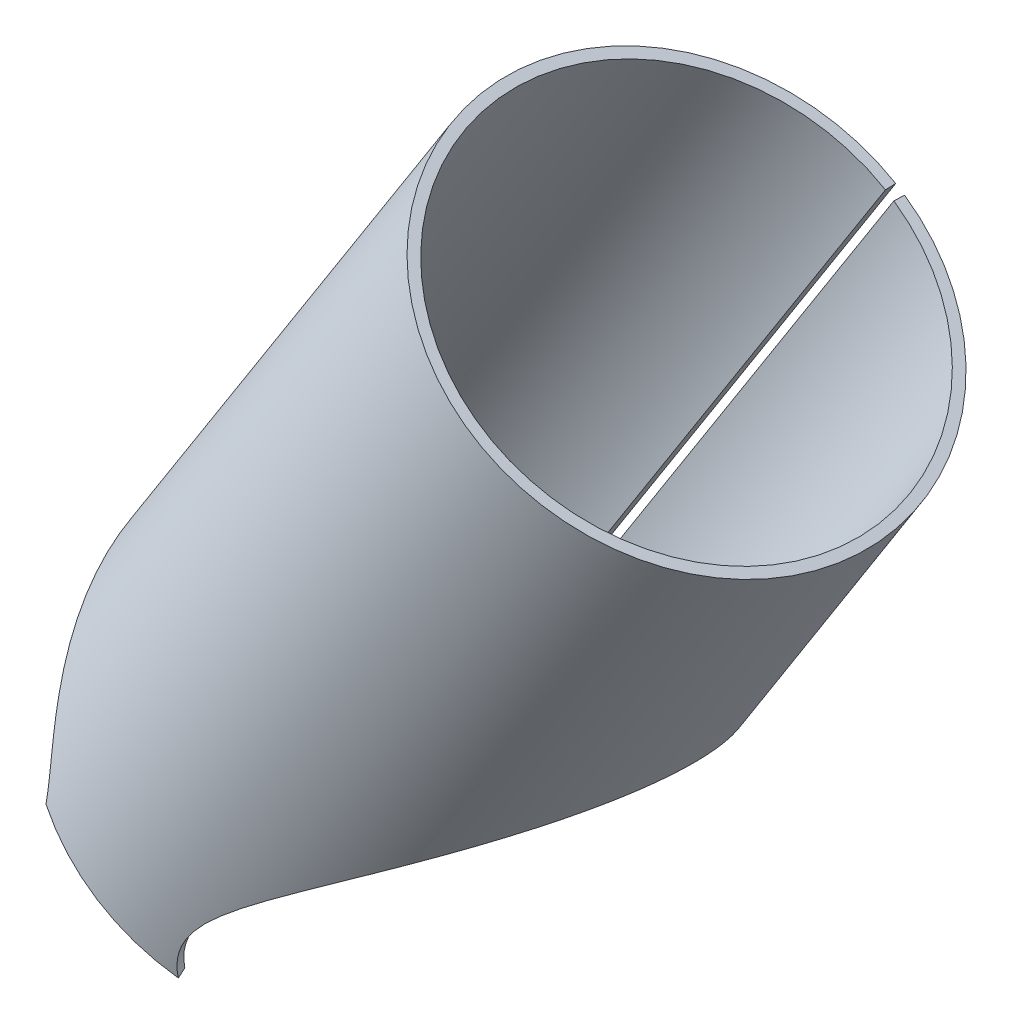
ISO-10303-21;
HEADER;
FILE_DESCRIPTION(('STEP AP214'),'2;1');
FILE_NAME('part.step','',(''),(''),'','','');
FILE_SCHEMA(('AUTOMOTIVE_DESIGN { 1 0 10303 214 1 1 1 1 }'));
ENDSEC;
DATA;
#1=APPLICATION_CONTEXT('core data for automotive mechanical design processes');
#2=APPLICATION_PROTOCOL_DEFINITION('international standard','automotive_design',2000,#1);
#3=PRODUCT_CONTEXT('',#1,'mechanical');
#4=PRODUCT('Part','Part','',(#3));
#5=PRODUCT_RELATED_PRODUCT_CATEGORY('part','',(#4));
#6=PRODUCT_DEFINITION_FORMATION('','',#4);
#7=PRODUCT_DEFINITION_CONTEXT('part definition',#1,'design');
#8=PRODUCT_DEFINITION('design','',#6,#7);
#9=PRODUCT_DEFINITION_SHAPE('','',#8);
#10=(LENGTH_UNIT() NAMED_UNIT(*) SI_UNIT(.MILLI.,.METRE.));
#11=(NAMED_UNIT(*) PLANE_ANGLE_UNIT() SI_UNIT($,.RADIAN.));
#12=(NAMED_UNIT(*) SI_UNIT($,.STERADIAN.) SOLID_ANGLE_UNIT());
#13=UNCERTAINTY_MEASURE_WITH_UNIT(LENGTH_MEASURE(1.E-05),#10,'distance_accuracy_value','');
#14=(GEOMETRIC_REPRESENTATION_CONTEXT(3) GLOBAL_UNCERTAINTY_ASSIGNED_CONTEXT((#13)) GLOBAL_UNIT_ASSIGNED_CONTEXT((#10,
#11,#12)) REPRESENTATION_CONTEXT('',''));
#15=CARTESIAN_POINT('',(0.,0.,0.));
#16=DIRECTION('',(0.,0.,1.));
#17=DIRECTION('',(1.,0.,0.));
#18=AXIS2_PLACEMENT_3D('',#15,#16,#17);
#19=CARTESIAN_POINT('',(17.4982367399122,28.3447563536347,-19.3625157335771));
#20=DIRECTION('',(0.843077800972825,-0.537231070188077,-0.0245478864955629));
#21=DIRECTION('',(-0.537393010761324,-0.843331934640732,0.));
#22=AXIS2_PLACEMENT_3D('',#19,#20,#21);
#23=PLANE('',#22);
#24=DIRECTION('',(-0.0207020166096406,0.0131918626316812,-0.999698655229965));
#25=VECTOR('',#24,1.);
#26=CARTESIAN_POINT('',(35.3974374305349,56.4340080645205,-19.3625157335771));
#27=LINE('',#26,#25);
#28=CARTESIAN_POINT('',(35.3974374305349,56.4340080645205,-19.3625157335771));
#29=VERTEX_POINT('',#28);
#30=CARTESIAN_POINT('',(35.3767354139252,56.4471999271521,-20.362214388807));
#31=VERTEX_POINT('',#30);
#32=EDGE_CURVE('E13',#29,#31,#27,.T.);
#33=ORIENTED_EDGE('',*,*,#32,.F.);
#34=DIRECTION('',(-0.537393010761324,-0.843331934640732,0.));
#35=VECTOR('',#34,1.);
#36=CARTESIAN_POINT('',(35.3974374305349,56.4340080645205,-19.3625157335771));
#37=LINE('',#36,#35);
#38=CARTESIAN_POINT('',(-0.400963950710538,0.255504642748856,-19.3625157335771));
#39=VERTEX_POINT('',#38);
#40=EDGE_CURVE('E114',#29,#39,#37,.T.);
#41=ORIENTED_EDGE('',*,*,#40,.T.);
#42=DIRECTION('',(-0.0207020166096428,0.0131918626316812,-0.999698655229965));
#43=VECTOR('',#42,1.);
#44=CARTESIAN_POINT('',(-0.400963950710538,0.255504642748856,-19.3625157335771));
#45=LINE('',#44,#43);
#46=CARTESIAN_POINT('',(-0.421665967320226,0.268696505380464,-20.362214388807));
#47=VERTEX_POINT('',#46);
#48=EDGE_CURVE('E51',#39,#47,#45,.T.);
#49=ORIENTED_EDGE('',*,*,#48,.T.);
#50=DIRECTION('',(0.537393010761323,0.843331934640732,0.));
#51=VECTOR('',#50,1.);
#52=CARTESIAN_POINT('',(-98.9407426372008,-154.337489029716,-20.362214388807));
#53=LINE('',#52,#51);
#54=EDGE_CURVE('E113',#31,#47,#53,.F.);
#55=ORIENTED_EDGE('',*,*,#54,.F.);
#56=EDGE_LOOP('',(#33,#41,#49,#55));
#57=FACE_BOUND('',#56,.T.);
#58=ADVANCED_FACE('F41',(#57),#23,.T.);
#59=CARTESIAN_POINT('',(0.,0.,0.));
#60=DIRECTION('',(-0.53739301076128,-0.84333193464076,0.));
#61=DIRECTION('',(0.84333193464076,-0.53739301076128,0.));
#62=AXIS2_PLACEMENT_3D('',#59,#60,#61);
#63=PLANE('',#62);
#64=ORIENTED_EDGE('',*,*,#48,.F.);
#65=CARTESIAN_POINT('',(0.,0.,0.));
#66=DIRECTION('',(0.53739301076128,0.84333193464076,0.));
#67=DIRECTION('',(-0.84333193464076,0.53739301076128,0.));
#68=AXIS2_PLACEMENT_3D('',#65,#66,#67);
#69=CIRCLE('',#68,19.3683522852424);
#70=CARTESIAN_POINT('',(-5.9942203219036,3.81967286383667,-18.017005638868));
#71=VERTEX_POINT('',#70);
#72=EDGE_CURVE('E151',#39,#71,#69,.T.);
#73=ORIENTED_EDGE('',*,*,#72,.T.);
#74=CARTESIAN_POINT('',(-6.30370562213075,4.01688493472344,-18.9472347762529));
#75=CARTESIAN_POINT('',(-5.9942203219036,3.81967286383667,-18.017005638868));
#76=B_SPLINE_CURVE_WITH_KNOTS('',1,(#74,#75),.UNSPECIFIED.,.F.,.F.,(2,2),(0.,1.),.UNSPECIFIED.);
#77=CARTESIAN_POINT('',(-6.30370562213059,4.01688493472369,-18.9472347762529));
#78=VERTEX_POINT('',#77);
#79=EDGE_CURVE('E119',#71,#78,#76,.F.);
#80=ORIENTED_EDGE('',*,*,#79,.T.);
#81=CARTESIAN_POINT('',(0.,0.,0.));
#82=DIRECTION('',(0.537393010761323,0.843331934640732,0.));
#83=DIRECTION('',(-0.843331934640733,0.537393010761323,0.));
#84=AXIS2_PLACEMENT_3D('',#81,#82,#83);
#85=CIRCLE('',#84,20.3683522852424);
#86=EDGE_CURVE('E127',#47,#78,#85,.T.);
#87=ORIENTED_EDGE('',*,*,#86,.F.);
#88=EDGE_LOOP('',(#64,#73,#80,#87));
#89=FACE_BOUND('',#88,.T.);
#90=ADVANCED_FACE('F131',(#89),#63,.T.);
#91=CARTESIAN_POINT('',(-6.30370562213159,4.01688493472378,18.9472347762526));
#92=CARTESIAN_POINT('',(-6.30488343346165,4.17183441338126,18.9139930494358));
#93=CARTESIAN_POINT('',(-6.30761729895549,4.301758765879,18.8849024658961));
#94=CARTESIAN_POINT('',(-6.31425353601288,4.45923664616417,18.8481089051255));
#95=CARTESIAN_POINT('',(-6.31685868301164,4.50974808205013,18.8360622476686));
#96=CARTESIAN_POINT('',(-6.3228126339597,4.61243015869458,18.8111776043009));
#97=CARTESIAN_POINT('',(-6.32616761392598,4.66370579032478,18.7985335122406));
#98=CARTESIAN_POINT('',(-6.34482303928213,4.91975086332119,18.7342821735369));
#99=CARTESIAN_POINT('',(-6.36585393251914,5.12544379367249,18.6791411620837));
#100=CARTESIAN_POINT('',(-6.42008174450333,5.54648624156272,18.5584890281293));
#101=CARTESIAN_POINT('',(-6.45331639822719,5.76089853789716,18.4931491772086));
#102=CARTESIAN_POINT('',(-6.53000948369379,6.1923693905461,18.3533292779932));
#103=CARTESIAN_POINT('',(-6.5736335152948,6.40992549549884,18.2786753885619));
#104=CARTESIAN_POINT('',(-6.71963537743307,7.06760806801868,18.0391415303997));
#105=CARTESIAN_POINT('',(-6.8375317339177,7.51272764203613,17.8584832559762));
#106=CARTESIAN_POINT('',(-7.10101967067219,8.41416487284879,17.4519622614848));
#107=CARTESIAN_POINT('',(-7.24763797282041,8.87042329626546,17.2257025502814));
#108=CARTESIAN_POINT('',(-7.56514854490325,9.79053113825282,16.7200243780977));
#109=CARTESIAN_POINT('',(-7.73690125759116,10.2563008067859,16.4390545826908));
#110=CARTESIAN_POINT('',(-8.08948363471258,11.1730184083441,15.830392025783));
#111=CARTESIAN_POINT('',(-8.2712760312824,11.6257810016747,15.5016992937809));
#112=CARTESIAN_POINT('',(-8.54781215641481,12.2937240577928,14.9693138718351));
#113=CARTESIAN_POINT('',(-8.64080568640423,12.5149102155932,14.7849335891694));
#114=CARTESIAN_POINT('',(-8.82643157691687,12.9511673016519,14.4043056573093));
#115=CARTESIAN_POINT('',(-8.91866302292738,13.1653119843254,14.2089020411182));
#116=CARTESIAN_POINT('',(-9.19285090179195,13.7953089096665,13.6074762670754));
#117=CARTESIAN_POINT('',(-9.37230549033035,14.1987269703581,13.1862214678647));
#118=CARTESIAN_POINT('',(-9.63334013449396,14.7769825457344,12.5244040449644));
#119=CARTESIAN_POINT('',(-9.71910948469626,14.9655124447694,12.298472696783));
#120=CARTESIAN_POINT('',(-9.88645495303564,15.3312489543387,11.8394101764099));
#121=CARTESIAN_POINT('',(-9.96812161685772,15.5086189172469,11.6061035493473));
#122=CARTESIAN_POINT('',(-10.2066619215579,16.0239526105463,10.8954124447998));
#123=CARTESIAN_POINT('',(-10.3570695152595,16.3451360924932,10.407248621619));
#124=CARTESIAN_POINT('',(-10.7791202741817,17.2394577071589,8.90438725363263));
#125=CARTESIAN_POINT('',(-11.0214724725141,17.7432912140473,7.8512047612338));
#126=CARTESIAN_POINT('',(-11.413094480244,18.5566046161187,5.67052998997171));
#127=CARTESIAN_POINT('',(-11.5625851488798,18.8631738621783,4.54678324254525));
#128=CARTESIAN_POINT('',(-11.7618390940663,19.2703239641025,2.26643906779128));
#129=CARTESIAN_POINT('',(-11.811578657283,19.3710999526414,1.10959845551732));
#130=CARTESIAN_POINT('',(-11.8088042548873,19.3654891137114,-1.20389031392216));
#131=CARTESIAN_POINT('',(-11.7562556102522,19.2591673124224,-2.35981252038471));
#132=CARTESIAN_POINT('',(-11.5517913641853,18.8413745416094,-4.63668785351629));
#133=CARTESIAN_POINT('',(-11.3999285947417,18.5294949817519,-5.75811214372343));
#134=CARTESIAN_POINT('',(-11.0043047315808,17.7071989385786,-7.93166844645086));
#135=CARTESIAN_POINT('',(-10.7602971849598,17.1998859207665,-8.98002591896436));
#136=CARTESIAN_POINT('',(-10.3368802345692,16.302244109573,-10.4743032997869));
#137=CARTESIAN_POINT('',(-10.1862019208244,15.9802694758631,-10.9593837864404));
#138=CARTESIAN_POINT('',(-9.94759230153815,15.464260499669,-11.6652051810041));
#139=CARTESIAN_POINT('',(-9.86595854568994,15.2867506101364,-11.8968479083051));
#140=CARTESIAN_POINT('',(-9.6987994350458,14.9209100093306,-12.3525173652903));
#141=CARTESIAN_POINT('',(-9.61323867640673,14.7325265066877,-12.5765783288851));
#142=CARTESIAN_POINT('',(-9.353017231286,14.1552574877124,-13.2326129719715));
#143=CARTESIAN_POINT('',(-9.17431796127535,13.7530558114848,-13.6499168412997));
#144=CARTESIAN_POINT('',(-8.81070929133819,12.9166343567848,-14.4438792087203));
#145=CARTESIAN_POINT('',(-8.62481773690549,12.4804588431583,-14.8220385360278));
#146=CARTESIAN_POINT('',(-8.25878882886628,11.5948956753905,-15.5246538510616));
#147=CARTESIAN_POINT('',(-8.0782094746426,11.1442811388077,-15.8504905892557));
#148=CARTESIAN_POINT('',(-7.7275344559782,10.230963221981,-16.4547042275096));
#149=CARTESIAN_POINT('',(-7.55649364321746,9.76657161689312,-16.7340027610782));
#150=CARTESIAN_POINT('',(-7.24048632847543,8.84875988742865,-17.2368027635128));
#151=CARTESIAN_POINT('',(-7.09453422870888,8.39327245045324,-17.4619847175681));
#152=CARTESIAN_POINT('',(-6.83210108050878,7.49255502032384,-17.8669181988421));
#153=CARTESIAN_POINT('',(-6.71453994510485,7.04731911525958,-18.0471003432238));
#154=CARTESIAN_POINT('',(-6.56929861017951,6.38915019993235,-18.2859535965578));
#155=CARTESIAN_POINT('',(-6.52594497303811,6.17137477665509,-18.3604015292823));
#156=CARTESIAN_POINT('',(-6.44982369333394,5.73934912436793,-18.4998473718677));
#157=CARTESIAN_POINT('',(-6.41689926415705,5.52461428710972,-18.565010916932));
#158=CARTESIAN_POINT('',(-6.36340584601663,5.10319553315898,-18.6852297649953));
#159=CARTESIAN_POINT('',(-6.342747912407,4.89697612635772,-18.7402410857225));
#160=CARTESIAN_POINT('',(-6.32466624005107,4.64132656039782,-18.8040723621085));
#161=CARTESIAN_POINT('',(-6.32143480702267,4.59024820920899,-18.8166038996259));
#162=CARTESIAN_POINT('',(-6.3157462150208,4.48819747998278,-18.8412083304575));
#163=CARTESIAN_POINT('',(-6.31329287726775,4.43673443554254,-18.853391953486));
#164=CARTESIAN_POINT('',(-6.30714809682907,4.27123200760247,-18.8916924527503));
#165=CARTESIAN_POINT('',(-6.30465051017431,4.14968121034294,-18.9187671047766));
#166=CARTESIAN_POINT('',(-6.30370562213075,4.01688493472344,-18.9472347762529));
#167=CARTESIAN_POINT('',(-5.99422032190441,3.819672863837,18.0170056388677));
#168=CARTESIAN_POINT('',(-5.99190934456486,3.9723991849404,17.9853959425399));
#169=CARTESIAN_POINT('',(-5.9916569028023,4.10042059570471,17.9577335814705));
#170=CARTESIAN_POINT('',(-5.99455749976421,4.25551802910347,17.922746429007));
#171=CARTESIAN_POINT('',(-5.99594779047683,4.3052553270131,17.9112912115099));
#172=CARTESIAN_POINT('',(-5.99940914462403,4.4063490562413,17.887628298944));
#173=CARTESIAN_POINT('',(-6.00150608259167,4.45682303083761,17.8756049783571));
#174=CARTESIAN_POINT('',(-6.01381304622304,4.70882269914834,17.8145081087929));
#175=CARTESIAN_POINT('',(-6.02953287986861,4.91113128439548,17.7620742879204));
#176=CARTESIAN_POINT('',(-6.07249890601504,5.32499742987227,17.6473456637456));
#177=CARTESIAN_POINT('',(-6.09980236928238,5.53563021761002,17.585213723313));
#178=CARTESIAN_POINT('',(-6.16421720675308,5.95927705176,17.452258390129));
#179=CARTESIAN_POINT('',(-6.20147732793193,6.17277790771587,17.3812696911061));
#180=CARTESIAN_POINT('',(-6.32774759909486,6.81788699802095,17.153495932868));
#181=CARTESIAN_POINT('',(-6.43162331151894,7.25407225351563,16.9817072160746));
#182=CARTESIAN_POINT('',(-6.66585375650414,8.13686585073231,16.5951446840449));
#183=CARTESIAN_POINT('',(-6.79720067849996,8.58339295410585,16.3799933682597));
#184=CARTESIAN_POINT('',(-7.08315200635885,9.48339042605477,15.8991418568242));
#185=CARTESIAN_POINT('',(-7.23854408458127,9.93873467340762,15.6319664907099));
#186=CARTESIAN_POINT('',(-7.55841803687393,10.8346096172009,15.0531866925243));
#187=CARTESIAN_POINT('',(-7.72378865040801,11.2769078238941,14.7406313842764));
#188=CARTESIAN_POINT('',(-7.97580697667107,11.9292275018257,14.2343838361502));
#189=CARTESIAN_POINT('',(-8.06063197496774,12.1452084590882,14.0590558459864));
#190=CARTESIAN_POINT('',(-8.23006947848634,12.5711498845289,13.6971151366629));
#191=CARTESIAN_POINT('',(-8.31431567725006,12.7802061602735,13.511305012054));
#192=CARTESIAN_POINT('',(-8.56491206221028,13.3951699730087,12.9394067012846));
#193=CARTESIAN_POINT('',(-8.72912442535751,13.7888752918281,12.5388337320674));
#194=CARTESIAN_POINT('',(-8.96817810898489,14.3531240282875,11.9095087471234));
#195=CARTESIAN_POINT('',(-9.04675778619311,14.5370724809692,11.6946696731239));
#196=CARTESIAN_POINT('',(-9.20012227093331,14.8938999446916,11.2581451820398));
#197=CARTESIAN_POINT('',(-9.27499082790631,15.0669379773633,11.0362929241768));
#198=CARTESIAN_POINT('',(-9.49373564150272,15.5696574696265,10.360493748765));
#199=CARTESIAN_POINT('',(-9.63174499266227,15.8829404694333,9.89629670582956));
#200=CARTESIAN_POINT('',(-10.0191599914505,16.7551912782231,8.467219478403));
#201=CARTESIAN_POINT('',(-10.2418394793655,17.2464888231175,7.46574379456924));
#202=CARTESIAN_POINT('',(-10.6016906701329,18.0395570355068,5.39213093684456));
#203=CARTESIAN_POINT('',(-10.7391402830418,18.3384534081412,4.32355540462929));
#204=CARTESIAN_POINT('',(-10.9223776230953,18.7353973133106,2.15516648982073));
#205=CARTESIAN_POINT('',(-10.9681381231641,18.8336377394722,1.05512186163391));
#206=CARTESIAN_POINT('',(-10.9655854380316,18.8281681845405,-1.1447843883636));
#207=CARTESIAN_POINT('',(-10.9172373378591,18.7245230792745,-2.24395570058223));
#208=CARTESIAN_POINT('',(-10.7292084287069,18.3172033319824,-4.40904607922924));
#209=CARTESIAN_POINT('',(-10.589587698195,18.0131247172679,-5.47541317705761));
#210=CARTESIAN_POINT('',(-10.22607425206,17.2112902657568,-7.54225705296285));
#211=CARTESIAN_POINT('',(-10.0018746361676,16.7165993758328,-8.53914460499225));
#212=CARTESIAN_POINT('',(-9.61321502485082,15.8411058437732,-9.96005928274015));
#213=CARTESIAN_POINT('',(-9.47496200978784,15.5270489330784,-10.4213243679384));
#214=CARTESIAN_POINT('',(-9.25616532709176,15.0236652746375,-11.0924929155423));
#215=CARTESIAN_POINT('',(-9.18133164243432,14.8504885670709,-11.3127629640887));
#216=CARTESIAN_POINT('',(-9.0281493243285,14.493554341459,-11.7460609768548));
#217=CARTESIAN_POINT('',(-8.94976769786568,14.3097455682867,-11.9591214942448));
#218=CARTESIAN_POINT('',(-8.71147686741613,13.7464513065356,-12.5829476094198));
#219=CARTESIAN_POINT('',(-8.54796638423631,13.3539283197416,-12.9797636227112));
#220=CARTESIAN_POINT('',(-8.21566453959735,12.537456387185,-13.7347457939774));
#221=CARTESIAN_POINT('',(-8.045968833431,12.111601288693,-14.0943390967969));
#222=CARTESIAN_POINT('',(-7.71242467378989,11.2467382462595,-14.7624589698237));
#223=CARTESIAN_POINT('',(-7.54817695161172,10.8065306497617,-15.0722985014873));
#224=CARTESIAN_POINT('',(-7.23006811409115,9.91396474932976,-15.6468478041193));
#225=CARTESIAN_POINT('',(-7.07533241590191,9.4599631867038,-15.9124339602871));
#226=CARTESIAN_POINT('',(-6.79078076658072,8.5621958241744,-16.3905486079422));
#227=CARTESIAN_POINT('',(-6.66005963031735,8.11641395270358,-16.6046750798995));
#228=CARTESIAN_POINT('',(-6.42683112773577,7.23430648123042,-16.9897280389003));
#229=CARTESIAN_POINT('',(-6.32328151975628,6.79799908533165,-17.1610640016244));
#230=CARTESIAN_POINT('',(-6.19775604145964,6.15239362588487,-17.3881905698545));
#231=CARTESIAN_POINT('',(-6.16076175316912,5.93867054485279,-17.4589834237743));
#232=CARTESIAN_POINT('',(-6.09691109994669,5.51446405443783,-17.5915830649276));
#233=CARTESIAN_POINT('',(-6.06991420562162,5.30350639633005,-17.6535473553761));
#234=CARTESIAN_POINT('',(-6.02766530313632,4.88925293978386,-17.7678639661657));
#235=CARTESIAN_POINT('',(-6.01231712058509,4.68641704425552,-17.8201744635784));
#236=CARTESIAN_POINT('',(-6.00055507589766,4.4347945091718,-17.8808718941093));
#237=CARTESIAN_POINT('',(-5.99857298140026,4.38451226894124,-17.8927881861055));
#238=CARTESIAN_POINT('',(-5.99535367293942,4.28403503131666,-17.9161846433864));
#239=CARTESIAN_POINT('',(-5.99413106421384,4.23335623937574,-17.9277701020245));
#240=CARTESIAN_POINT('',(-5.99188331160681,4.07033709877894,-17.9641902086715));
#241=CARTESIAN_POINT('',(-5.99217746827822,3.95056526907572,-17.9899356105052));
#242=CARTESIAN_POINT('',(-5.9942203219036,3.81967286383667,-18.017005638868));
#243=B_SPLINE_SURFACE_WITH_KNOTS('',1,3,((#91,#92,#93,#94,#95,#96,#97,#98,#99,#100,#101,#102,
#103,#104,#105,#106,#107,#108,#109,#110,#111,#112,#113,#114,#115,#116,#117,#118,#119,#120,#121,
#122,#123,#124,#125,#126,#127,#128,#129,#130,#131,#132,#133,#134,#135,#136,#137,#138,#139,#140,
#141,#142,#143,#144,#145,#146,#147,#148,#149,#150,#151,#152,#153,#154,#155,#156,#157,#158,#159,
#160,#161,#162,#163,#164,#165,#166),(#167,#168,#169,#170,#171,#172,#173,#174,#175,#176,#177,
#178,#179,#180,#181,#182,#183,#184,#185,#186,#187,#188,#189,#190,#191,#192,#193,#194,#195,#196,
#197,#198,#199,#200,#201,#202,#203,#204,#205,#206,#207,#208,#209,#210,#211,#212,#213,#214,#215,
#216,#217,#218,#219,#220,#221,#222,#223,#224,#225,#226,#227,#228,#229,#230,#231,#232,#233,#234,
#235,#236,#237,#238,#239,#240,#241,#242)),.UNSPECIFIED.,.F.,.F.,.F.,(2,2),(4,2,2,2,2,2,2,2,2,2,
2,2,2,2,2,2,2,2,2,2,2,2,2,2,2,2,2,2,2,2,2,2,2,2,2,2,2,4),(0.,1.),(0.,0.0078125,0.01171875,
0.015625,0.03125,0.046875,0.0625,0.09375,0.125,0.15625,0.1875,0.203125,0.21875,0.25,0.265625,
0.28125,0.3125,0.375,0.4375,0.5,0.5625,0.625,0.6875,0.71875,0.734375,0.75,0.78125,0.8125,
0.84375,0.875,0.90625,0.9375,0.953125,0.96875,0.984375,0.98828125,0.9921875,1.),.UNSPECIFIED.);
#244=CARTESIAN_POINT('',(-5.9942203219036,3.81967286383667,-18.017005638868));
#245=CARTESIAN_POINT('',(-5.99217746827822,3.95056526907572,-17.9899356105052));
#246=CARTESIAN_POINT('',(-5.99188331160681,4.07033709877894,-17.9641902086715));
#247=CARTESIAN_POINT('',(-5.99413106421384,4.23335623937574,-17.9277701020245));
#248=CARTESIAN_POINT('',(-5.99535367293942,4.28403503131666,-17.9161846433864));
#249=CARTESIAN_POINT('',(-5.99857298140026,4.38451226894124,-17.8927881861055));
#250=CARTESIAN_POINT('',(-6.00055507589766,4.4347945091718,-17.8808718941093));
#251=CARTESIAN_POINT('',(-6.01231712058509,4.68641704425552,-17.8201744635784));
#252=CARTESIAN_POINT('',(-6.02766530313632,4.88925293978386,-17.7678639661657));
#253=CARTESIAN_POINT('',(-6.06991420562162,5.30350639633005,-17.6535473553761));
#254=CARTESIAN_POINT('',(-6.09691109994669,5.51446405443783,-17.5915830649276));
#255=CARTESIAN_POINT('',(-6.16076175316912,5.93867054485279,-17.4589834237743));
#256=CARTESIAN_POINT('',(-6.19775604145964,6.15239362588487,-17.3881905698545));
#257=CARTESIAN_POINT('',(-6.32328151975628,6.79799908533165,-17.1610640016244));
#258=CARTESIAN_POINT('',(-6.42683112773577,7.23430648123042,-16.9897280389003));
#259=CARTESIAN_POINT('',(-6.66005963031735,8.11641395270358,-16.6046750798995));
#260=CARTESIAN_POINT('',(-6.79078076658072,8.5621958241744,-16.3905486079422));
#261=CARTESIAN_POINT('',(-7.07533241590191,9.4599631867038,-15.9124339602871));
#262=CARTESIAN_POINT('',(-7.23006811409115,9.91396474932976,-15.6468478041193));
#263=CARTESIAN_POINT('',(-7.54817695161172,10.8065306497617,-15.0722985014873));
#264=CARTESIAN_POINT('',(-7.71242467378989,11.2467382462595,-14.7624589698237));
#265=CARTESIAN_POINT('',(-8.045968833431,12.111601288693,-14.0943390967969));
#266=CARTESIAN_POINT('',(-8.21566453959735,12.537456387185,-13.7347457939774));
#267=CARTESIAN_POINT('',(-8.54796638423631,13.3539283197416,-12.9797636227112));
#268=CARTESIAN_POINT('',(-8.71147686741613,13.7464513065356,-12.5829476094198));
#269=CARTESIAN_POINT('',(-8.94976769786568,14.3097455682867,-11.9591214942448));
#270=CARTESIAN_POINT('',(-9.0281493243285,14.493554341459,-11.7460609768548));
#271=CARTESIAN_POINT('',(-9.18133164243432,14.8504885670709,-11.3127629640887));
#272=CARTESIAN_POINT('',(-9.25616532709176,15.0236652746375,-11.0924929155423));
#273=CARTESIAN_POINT('',(-9.47496200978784,15.5270489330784,-10.4213243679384));
#274=CARTESIAN_POINT('',(-9.61321502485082,15.8411058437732,-9.96005928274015));
#275=CARTESIAN_POINT('',(-10.0018746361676,16.7165993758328,-8.53914460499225));
#276=CARTESIAN_POINT('',(-10.22607425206,17.2112902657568,-7.54225705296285));
#277=CARTESIAN_POINT('',(-10.589587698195,18.0131247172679,-5.47541317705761));
#278=CARTESIAN_POINT('',(-10.7292084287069,18.3172033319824,-4.40904607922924));
#279=CARTESIAN_POINT('',(-10.9172373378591,18.7245230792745,-2.24395570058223));
#280=CARTESIAN_POINT('',(-10.9655854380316,18.8281681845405,-1.1447843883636));
#281=CARTESIAN_POINT('',(-10.9681381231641,18.8336377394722,1.05512186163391));
#282=CARTESIAN_POINT('',(-10.9223776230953,18.7353973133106,2.15516648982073));
#283=CARTESIAN_POINT('',(-10.7391402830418,18.3384534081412,4.32355540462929));
#284=CARTESIAN_POINT('',(-10.6016906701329,18.0395570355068,5.39213093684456));
#285=CARTESIAN_POINT('',(-10.2418394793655,17.2464888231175,7.46574379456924));
#286=CARTESIAN_POINT('',(-10.0191599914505,16.7551912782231,8.467219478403));
#287=CARTESIAN_POINT('',(-9.63174499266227,15.8829404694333,9.89629670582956));
#288=CARTESIAN_POINT('',(-9.49373564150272,15.5696574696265,10.360493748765));
#289=CARTESIAN_POINT('',(-9.27499082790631,15.0669379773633,11.0362929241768));
#290=CARTESIAN_POINT('',(-9.20012227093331,14.8938999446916,11.2581451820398));
#291=CARTESIAN_POINT('',(-9.04675778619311,14.5370724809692,11.6946696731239));
#292=CARTESIAN_POINT('',(-8.96817810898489,14.3531240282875,11.9095087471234));
#293=CARTESIAN_POINT('',(-8.72912442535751,13.7888752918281,12.5388337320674));
#294=CARTESIAN_POINT('',(-8.56491206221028,13.3951699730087,12.9394067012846));
#295=CARTESIAN_POINT('',(-8.31431567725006,12.7802061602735,13.511305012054));
#296=CARTESIAN_POINT('',(-8.23006947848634,12.5711498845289,13.6971151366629));
#297=CARTESIAN_POINT('',(-8.06063197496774,12.1452084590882,14.0590558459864));
#298=CARTESIAN_POINT('',(-7.97580697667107,11.9292275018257,14.2343838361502));
#299=CARTESIAN_POINT('',(-7.72378865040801,11.2769078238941,14.7406313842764));
#300=CARTESIAN_POINT('',(-7.55841803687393,10.8346096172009,15.0531866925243));
#301=CARTESIAN_POINT('',(-7.23854408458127,9.93873467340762,15.6319664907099));
#302=CARTESIAN_POINT('',(-7.08315200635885,9.48339042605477,15.8991418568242));
#303=CARTESIAN_POINT('',(-6.79720067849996,8.58339295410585,16.3799933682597));
#304=CARTESIAN_POINT('',(-6.66585375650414,8.13686585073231,16.5951446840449));
#305=CARTESIAN_POINT('',(-6.43162331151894,7.25407225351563,16.9817072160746));
#306=CARTESIAN_POINT('',(-6.32774759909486,6.81788699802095,17.153495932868));
#307=CARTESIAN_POINT('',(-6.20147732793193,6.17277790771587,17.3812696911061));
#308=CARTESIAN_POINT('',(-6.16421720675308,5.95927705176,17.452258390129));
#309=CARTESIAN_POINT('',(-6.09980236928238,5.53563021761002,17.585213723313));
#310=CARTESIAN_POINT('',(-6.07249890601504,5.32499742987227,17.6473456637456));
#311=CARTESIAN_POINT('',(-6.02953287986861,4.91113128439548,17.7620742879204));
#312=CARTESIAN_POINT('',(-6.01381304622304,4.70882269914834,17.8145081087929));
#313=CARTESIAN_POINT('',(-6.00150608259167,4.45682303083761,17.8756049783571));
#314=CARTESIAN_POINT('',(-5.99940914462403,4.4063490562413,17.887628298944));
#315=CARTESIAN_POINT('',(-5.99594779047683,4.3052553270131,17.9112912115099));
#316=CARTESIAN_POINT('',(-5.99455749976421,4.25551802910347,17.922746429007));
#317=CARTESIAN_POINT('',(-5.9916569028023,4.10042059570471,17.9577335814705));
#318=CARTESIAN_POINT('',(-5.99190934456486,3.9723991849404,17.9853959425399));
#319=CARTESIAN_POINT('',(-5.99422032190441,3.819672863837,18.0170056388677));
#320=B_SPLINE_CURVE_WITH_KNOTS('',3,(#244,#245,#246,#247,#248,#249,#250,#251,#252,#253,#254,
#255,#256,#257,#258,#259,#260,#261,#262,#263,#264,#265,#266,#267,#268,#269,#270,#271,#272,#273,
#274,#275,#276,#277,#278,#279,#280,#281,#282,#283,#284,#285,#286,#287,#288,#289,#290,#291,#292,
#293,#294,#295,#296,#297,#298,#299,#300,#301,#302,#303,#304,#305,#306,#307,#308,#309,#310,#311,
#312,#313,#314,#315,#316,#317,#318,#319),.UNSPECIFIED.,.F.,.F.,(4,2,2,2,2,2,2,2,2,2,2,2,2,2,2,2,
2,2,2,2,2,2,2,2,2,2,2,2,2,2,2,2,2,2,2,2,2,4),(0.,0.0078125,0.01171875,0.015625,0.03125,0.046875,
0.0625,0.09375,0.125,0.15625,0.1875,0.21875,0.25,0.265625,0.28125,0.3125,0.375,0.4375,0.5,
0.5625,0.625,0.6875,0.71875,0.734375,0.75,0.78125,0.796875,0.8125,0.84375,0.875,0.90625,0.9375,
0.953125,0.96875,0.984375,0.98828125,0.9921875,1.),.UNSPECIFIED.);
#321=CARTESIAN_POINT('',(-5.99422032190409,3.8196728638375,18.0170056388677));
#322=VERTEX_POINT('',#321);
#323=EDGE_CURVE('E150',#322,#71,#320,.F.);
#324=CARTESIAN_POINT('',(-5.99422032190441,3.819672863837,18.0170056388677));
#325=CARTESIAN_POINT('',(-6.30370562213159,4.01688493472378,18.9472347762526));
#326=B_SPLINE_CURVE_WITH_KNOTS('',1,(#324,#325),.UNSPECIFIED.,.F.,.F.,(2,2),(0.,1.),.UNSPECIFIED.);
#327=CARTESIAN_POINT('',(-6.30370562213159,4.01688493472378,18.9472347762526));
#328=VERTEX_POINT('',#327);
#329=EDGE_CURVE('E275',#322,#328,#326,.T.);
#330=CARTESIAN_POINT('',(-6.30370562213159,4.01688493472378,18.9472347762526));
#331=CARTESIAN_POINT('',(-6.30488343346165,4.17183441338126,18.9139930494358));
#332=CARTESIAN_POINT('',(-6.30761729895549,4.301758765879,18.8849024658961));
#333=CARTESIAN_POINT('',(-6.31425353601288,4.45923664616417,18.8481089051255));
#334=CARTESIAN_POINT('',(-6.31685868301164,4.50974808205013,18.8360622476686));
#335=CARTESIAN_POINT('',(-6.3228126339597,4.61243015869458,18.8111776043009));
#336=CARTESIAN_POINT('',(-6.32616761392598,4.66370579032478,18.7985335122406));
#337=CARTESIAN_POINT('',(-6.34482303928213,4.91975086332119,18.7342821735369));
#338=CARTESIAN_POINT('',(-6.36585393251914,5.12544379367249,18.6791411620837));
#339=CARTESIAN_POINT('',(-6.42008174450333,5.54648624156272,18.5584890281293));
#340=CARTESIAN_POINT('',(-6.45331639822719,5.76089853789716,18.4931491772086));
#341=CARTESIAN_POINT('',(-6.53000948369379,6.1923693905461,18.3533292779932));
#342=CARTESIAN_POINT('',(-6.5736335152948,6.40992549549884,18.2786753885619));
#343=CARTESIAN_POINT('',(-6.71963537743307,7.06760806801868,18.0391415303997));
#344=CARTESIAN_POINT('',(-6.8375317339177,7.51272764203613,17.8584832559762));
#345=CARTESIAN_POINT('',(-7.10101967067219,8.41416487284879,17.4519622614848));
#346=CARTESIAN_POINT('',(-7.24763797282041,8.87042329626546,17.2257025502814));
#347=CARTESIAN_POINT('',(-7.56514854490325,9.79053113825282,16.7200243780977));
#348=CARTESIAN_POINT('',(-7.73690125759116,10.2563008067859,16.4390545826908));
#349=CARTESIAN_POINT('',(-8.08948363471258,11.1730184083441,15.830392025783));
#350=CARTESIAN_POINT('',(-8.2712760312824,11.6257810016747,15.5016992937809));
#351=CARTESIAN_POINT('',(-8.54781215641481,12.2937240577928,14.9693138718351));
#352=CARTESIAN_POINT('',(-8.64080568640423,12.5149102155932,14.7849335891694));
#353=CARTESIAN_POINT('',(-8.82643157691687,12.9511673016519,14.4043056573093));
#354=CARTESIAN_POINT('',(-8.91866302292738,13.1653119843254,14.2089020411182));
#355=CARTESIAN_POINT('',(-9.19285090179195,13.7953089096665,13.6074762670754));
#356=CARTESIAN_POINT('',(-9.37230549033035,14.1987269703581,13.1862214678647));
#357=CARTESIAN_POINT('',(-9.63334013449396,14.7769825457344,12.5244040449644));
#358=CARTESIAN_POINT('',(-9.71910948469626,14.9655124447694,12.298472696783));
#359=CARTESIAN_POINT('',(-9.88645495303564,15.3312489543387,11.8394101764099));
#360=CARTESIAN_POINT('',(-9.96812161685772,15.5086189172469,11.6061035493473));
#361=CARTESIAN_POINT('',(-10.2066619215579,16.0239526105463,10.8954124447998));
#362=CARTESIAN_POINT('',(-10.3570695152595,16.3451360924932,10.407248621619));
#363=CARTESIAN_POINT('',(-10.7791202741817,17.2394577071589,8.90438725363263));
#364=CARTESIAN_POINT('',(-11.0214724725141,17.7432912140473,7.8512047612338));
#365=CARTESIAN_POINT('',(-11.413094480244,18.5566046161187,5.67052998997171));
#366=CARTESIAN_POINT('',(-11.5625851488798,18.8631738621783,4.54678324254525));
#367=CARTESIAN_POINT('',(-11.7618390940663,19.2703239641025,2.26643906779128));
#368=CARTESIAN_POINT('',(-11.811578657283,19.3710999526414,1.10959845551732));
#369=CARTESIAN_POINT('',(-11.8088042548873,19.3654891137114,-1.20389031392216));
#370=CARTESIAN_POINT('',(-11.7562556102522,19.2591673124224,-2.35981252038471));
#371=CARTESIAN_POINT('',(-11.5517913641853,18.8413745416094,-4.63668785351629));
#372=CARTESIAN_POINT('',(-11.3999285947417,18.5294949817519,-5.75811214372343));
#373=CARTESIAN_POINT('',(-11.0043047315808,17.7071989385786,-7.93166844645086));
#374=CARTESIAN_POINT('',(-10.7602971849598,17.1998859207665,-8.98002591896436));
#375=CARTESIAN_POINT('',(-10.3368802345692,16.302244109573,-10.4743032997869));
#376=CARTESIAN_POINT('',(-10.1862019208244,15.9802694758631,-10.9593837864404));
#377=CARTESIAN_POINT('',(-9.94759230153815,15.464260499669,-11.6652051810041));
#378=CARTESIAN_POINT('',(-9.86595854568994,15.2867506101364,-11.8968479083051));
#379=CARTESIAN_POINT('',(-9.6987994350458,14.9209100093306,-12.3525173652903));
#380=CARTESIAN_POINT('',(-9.61323867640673,14.7325265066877,-12.5765783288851));
#381=CARTESIAN_POINT('',(-9.353017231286,14.1552574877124,-13.2326129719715));
#382=CARTESIAN_POINT('',(-9.17431796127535,13.7530558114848,-13.6499168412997));
#383=CARTESIAN_POINT('',(-8.81070929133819,12.9166343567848,-14.4438792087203));
#384=CARTESIAN_POINT('',(-8.62481773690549,12.4804588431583,-14.8220385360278));
#385=CARTESIAN_POINT('',(-8.25878882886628,11.5948956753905,-15.5246538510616));
#386=CARTESIAN_POINT('',(-8.0782094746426,11.1442811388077,-15.8504905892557));
#387=CARTESIAN_POINT('',(-7.7275344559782,10.230963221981,-16.4547042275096));
#388=CARTESIAN_POINT('',(-7.55649364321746,9.76657161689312,-16.7340027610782));
#389=CARTESIAN_POINT('',(-7.24048632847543,8.84875988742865,-17.2368027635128));
#390=CARTESIAN_POINT('',(-7.09453422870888,8.39327245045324,-17.4619847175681));
#391=CARTESIAN_POINT('',(-6.83210108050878,7.49255502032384,-17.8669181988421));
#392=CARTESIAN_POINT('',(-6.71453994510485,7.04731911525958,-18.0471003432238));
#393=CARTESIAN_POINT('',(-6.56929861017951,6.38915019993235,-18.2859535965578));
#394=CARTESIAN_POINT('',(-6.52594497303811,6.17137477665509,-18.3604015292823));
#395=CARTESIAN_POINT('',(-6.44982369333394,5.73934912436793,-18.4998473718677));
#396=CARTESIAN_POINT('',(-6.41689926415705,5.52461428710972,-18.565010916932));
#397=CARTESIAN_POINT('',(-6.36340584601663,5.10319553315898,-18.6852297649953));
#398=CARTESIAN_POINT('',(-6.342747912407,4.89697612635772,-18.7402410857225));
#399=CARTESIAN_POINT('',(-6.32466624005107,4.64132656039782,-18.8040723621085));
#400=CARTESIAN_POINT('',(-6.32143480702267,4.59024820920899,-18.8166038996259));
#401=CARTESIAN_POINT('',(-6.3157462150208,4.48819747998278,-18.8412083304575));
#402=CARTESIAN_POINT('',(-6.31329287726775,4.43673443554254,-18.853391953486));
#403=CARTESIAN_POINT('',(-6.30714809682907,4.27123200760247,-18.8916924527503));
#404=CARTESIAN_POINT('',(-6.30465051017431,4.14968121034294,-18.9187671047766));
#405=CARTESIAN_POINT('',(-6.30370562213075,4.01688493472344,-18.9472347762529));
#406=B_SPLINE_CURVE_WITH_KNOTS('',3,(#330,#331,#332,#333,#334,#335,#336,#337,#338,#339,#340,
#341,#342,#343,#344,#345,#346,#347,#348,#349,#350,#351,#352,#353,#354,#355,#356,#357,#358,#359,
#360,#361,#362,#363,#364,#365,#366,#367,#368,#369,#370,#371,#372,#373,#374,#375,#376,#377,#378,
#379,#380,#381,#382,#383,#384,#385,#386,#387,#388,#389,#390,#391,#392,#393,#394,#395,#396,#397,
#398,#399,#400,#401,#402,#403,#404,#405),.UNSPECIFIED.,.F.,.F.,(4,2,2,2,2,2,2,2,2,2,2,2,2,2,2,2,
2,2,2,2,2,2,2,2,2,2,2,2,2,2,2,2,2,2,2,2,2,4),(0.,0.0078125,0.01171875,0.015625,0.03125,0.046875,
0.0625,0.09375,0.125,0.15625,0.1875,0.203125,0.21875,0.25,0.265625,0.28125,0.3125,0.375,0.4375,
0.5,0.5625,0.625,0.6875,0.71875,0.734375,0.75,0.78125,0.8125,0.84375,0.875,0.90625,0.9375,
0.953125,0.96875,0.984375,0.98828125,0.9921875,1.),.UNSPECIFIED.);
#407=EDGE_CURVE('E133',#328,#78,#406,.T.);
#408=ORIENTED_EDGE('',*,*,#79,.F.);
#409=ORIENTED_EDGE('',*,*,#323,.F.);
#410=ORIENTED_EDGE('',*,*,#329,.T.);
#411=ORIENTED_EDGE('',*,*,#407,.T.);
#412=EDGE_LOOP('',(#408,#409,#410,#411));
#413=FACE_BOUND('',#412,.T.);
#414=ADVANCED_FACE('F280',(#413),#243,.F.);
#415=CARTESIAN_POINT('',(0.,0.,0.));
#416=DIRECTION('',(-0.537393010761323,-0.843331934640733,0.));
#417=DIRECTION('',(0.843331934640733,-0.537393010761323,0.));
#418=AXIS2_PLACEMENT_3D('',#415,#416,#417);
#419=PLANE('',#418);
#420=ORIENTED_EDGE('',*,*,#329,.F.);
#421=CARTESIAN_POINT('',(0.,0.,0.));
#422=DIRECTION('',(0.537393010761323,0.843331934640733,0.));
#423=DIRECTION('',(-0.843331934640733,0.537393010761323,0.));
#424=AXIS2_PLACEMENT_3D('',#421,#422,#423);
#425=CIRCLE('',#424,19.3683522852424);
#426=CARTESIAN_POINT('',(5.99422032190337,-3.81967286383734,18.017005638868));
#427=VERTEX_POINT('',#426);
#428=EDGE_CURVE('E197',#322,#427,#425,.T.);
#429=ORIENTED_EDGE('',*,*,#428,.T.);
#430=CARTESIAN_POINT('',(6.30370562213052,-4.0168849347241,18.9472347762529));
#431=CARTESIAN_POINT('',(5.99422032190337,-3.81967286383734,18.017005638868));
#432=B_SPLINE_CURVE_WITH_KNOTS('',1,(#430,#431),.UNSPECIFIED.,.F.,.F.,(2,2),(0.,1.),.UNSPECIFIED.);
#433=CARTESIAN_POINT('',(6.30370562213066,-4.01688493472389,18.9472347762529));
#434=VERTEX_POINT('',#433);
#435=EDGE_CURVE('E255',#427,#434,#432,.F.);
#436=ORIENTED_EDGE('',*,*,#435,.T.);
#437=CARTESIAN_POINT('',(0.,0.,0.));
#438=DIRECTION('',(0.537393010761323,0.843331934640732,0.));
#439=DIRECTION('',(-0.843331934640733,0.537393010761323,0.));
#440=AXIS2_PLACEMENT_3D('',#437,#438,#439);
#441=CIRCLE('',#440,20.3683522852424);
#442=EDGE_CURVE('E135',#328,#434,#441,.T.);
#443=ORIENTED_EDGE('',*,*,#442,.F.);
#444=EDGE_LOOP('',(#420,#429,#436,#443));
#445=FACE_BOUND('',#444,.T.);
#446=ADVANCED_FACE('F217',(#445),#419,.T.);
#447=CARTESIAN_POINT('',(6.3037056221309,-4.01688493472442,-18.9472347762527));
#448=CARTESIAN_POINT('',(6.30493455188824,-3.86962796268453,-18.9780449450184));
#449=CARTESIAN_POINT('',(6.30732391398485,-3.75159053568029,-19.001742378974));
#450=CARTESIAN_POINT('',(6.3128940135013,-3.61851940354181,-19.0273549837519));
#451=CARTESIAN_POINT('',(6.31508846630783,-3.57601863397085,-19.0353579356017));
#452=CARTESIAN_POINT('',(6.32016329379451,-3.48949257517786,-19.0513785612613));
#453=CARTESIAN_POINT('',(6.32304238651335,-3.44631036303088,-19.0592229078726));
#454=CARTESIAN_POINT('',(6.33915210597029,-3.23080712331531,-19.0976315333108));
#455=CARTESIAN_POINT('',(6.35755381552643,-3.05981846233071,-19.125726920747));
#456=CARTESIAN_POINT('',(6.42981173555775,-2.55241457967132,-19.2024037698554));
#457=CARTESIAN_POINT('',(6.50066422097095,-2.22109918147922,-19.2435178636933));
#458=CARTESIAN_POINT('',(6.69230621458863,-1.57187808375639,-19.3074664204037));
#459=CARTESIAN_POINT('',(6.81372043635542,-1.25373460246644,-19.3301840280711));
#460=CARTESIAN_POINT('',(7.10022457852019,-0.633325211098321,-19.3604264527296));
#461=CARTESIAN_POINT('',(7.2646507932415,-0.33127561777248,-19.3680816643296));
#462=CARTESIAN_POINT('',(7.63598704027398,0.256427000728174,-19.3689497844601));
#463=CARTESIAN_POINT('',(7.8417706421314,0.543573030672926,-19.3627193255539));
#464=CARTESIAN_POINT('',(8.28923162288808,1.11015342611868,-19.3387745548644));
#465=CARTESIAN_POINT('',(8.52996421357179,1.38628377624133,-19.320742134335));
#466=CARTESIAN_POINT('',(9.06302058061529,1.95202203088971,-19.2715619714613));
#467=CARTESIAN_POINT('',(9.35396246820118,2.23948906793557,-19.2404189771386));
#468=CARTESIAN_POINT('',(9.98420760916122,2.82391593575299,-19.1634881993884));
#469=CARTESIAN_POINT('',(10.3228171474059,3.12027623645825,-19.1177999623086));
#470=CARTESIAN_POINT('',(11.0508880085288,3.72568475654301,-19.0091838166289));
#471=CARTESIAN_POINT('',(11.4417158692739,4.03590728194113,-18.9460556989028));
#472=CARTESIAN_POINT('',(12.2758954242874,4.67206497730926,-18.7992593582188));
#473=CARTESIAN_POINT('',(12.7204949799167,4.99888896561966,-18.7153308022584));
#474=CARTESIAN_POINT('',(13.6541361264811,5.66443172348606,-18.5247979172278));
#475=CARTESIAN_POINT('',(14.1426056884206,6.00273005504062,-18.4183300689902));
#476=CARTESIAN_POINT('',(14.9064735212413,6.51930274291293,-18.2391200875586));
#477=CARTESIAN_POINT('',(15.1671715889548,6.69358929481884,-18.1758999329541));
#478=CARTESIAN_POINT('',(15.6937530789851,7.04218658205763,-18.0437351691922));
#479=CARTESIAN_POINT('',(15.9594127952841,7.21634694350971,-17.9748601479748));
#480=CARTESIAN_POINT('',(16.4952579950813,7.5645263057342,-17.831197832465));
#481=CARTESIAN_POINT('',(16.7654435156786,7.73854528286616,-17.756410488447));
#482=CARTESIAN_POINT('',(17.3101083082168,8.08658972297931,-17.6005915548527));
#483=CARTESIAN_POINT('',(17.5853987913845,8.26108565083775,-17.5192955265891));
#484=CARTESIAN_POINT('',(18.410431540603,8.78082757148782,-17.2677785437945));
#485=CARTESIAN_POINT('',(18.958743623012,9.12195001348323,-17.0901784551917));
#486=CARTESIAN_POINT('',(20.0505478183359,9.7943429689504,-16.7139891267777));
#487=CARTESIAN_POINT('',(20.5940400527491,10.1256134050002,-16.5153991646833));
#488=CARTESIAN_POINT('',(21.404503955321,10.6158689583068,-16.2009725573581));
#489=CARTESIAN_POINT('',(21.6738616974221,10.7781798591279,-16.0934074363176));
#490=CARTESIAN_POINT('',(22.2107762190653,11.1007184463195,-15.8726408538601));
#491=CARTESIAN_POINT('',(22.4790128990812,11.2613820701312,-15.7591488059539));
#492=CARTESIAN_POINT('',(23.8031878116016,12.052196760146,-15.1823738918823));
#493=CARTESIAN_POINT('',(24.8124179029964,12.6474015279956,-14.6895845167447));
#494=CARTESIAN_POINT('',(26.7244536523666,13.7668709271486,-13.6454184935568));
#495=CARTESIAN_POINT('',(27.6291207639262,14.2925047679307,-13.0926169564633));
#496=CARTESIAN_POINT('',(30.1413291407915,15.7464304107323,-11.3766943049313));
#497=CARTESIAN_POINT('',(31.5566659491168,16.5571255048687,-10.1517712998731));
#498=CARTESIAN_POINT('',(33.2850005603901,17.5442270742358,-8.23666805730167));
#499=CARTESIAN_POINT('',(33.7953764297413,17.8350631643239,-7.5853249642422));
#500=CARTESIAN_POINT('',(34.6838614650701,18.3408466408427,-6.2645628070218));
#501=CARTESIAN_POINT('',(35.0614077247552,18.5555451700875,-5.59695426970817));
#502=CARTESIAN_POINT('',(35.531782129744,18.8219318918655,-4.57792672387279));
#503=CARTESIAN_POINT('',(35.6724437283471,18.9014779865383,-4.23539751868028));
#504=CARTESIAN_POINT('',(35.9204078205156,19.042351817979,-3.55021563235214));
#505=CARTESIAN_POINT('',(36.0278580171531,19.1036354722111,-3.20701588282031));
#506=CARTESIAN_POINT('',(36.2098546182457,19.2077943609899,-2.52035691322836));
#507=CARTESIAN_POINT('',(36.2844730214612,19.2505416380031,-2.17641673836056));
#508=CARTESIAN_POINT('',(36.4007194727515,19.3163289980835,-1.48111386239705));
#509=CARTESIAN_POINT('',(36.4422967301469,19.3395646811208,-1.13071589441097));
#510=CARTESIAN_POINT('',(36.4918006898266,19.3670760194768,-0.425324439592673));
#511=CARTESIAN_POINT('',(36.4997156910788,19.3713903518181,-0.0691498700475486));
#512=CARTESIAN_POINT('',(36.4814163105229,19.3611972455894,0.640519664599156));
#513=CARTESIAN_POINT('',(36.45526581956,19.3466351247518,0.993482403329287));
#514=CARTESIAN_POINT('',(36.3694529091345,19.2982677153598,1.69473109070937));
#515=CARTESIAN_POINT('',(36.31000037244,19.2644677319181,2.04253292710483));
#516=CARTESIAN_POINT('',(36.1542477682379,19.1754662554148,2.74786464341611));
#517=CARTESIAN_POINT('',(36.0581998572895,19.1205899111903,3.10374927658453));
#518=CARTESIAN_POINT('',(35.7146194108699,18.9258049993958,4.17694958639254));
#519=CARTESIAN_POINT('',(35.4147543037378,18.756061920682,4.88576883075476));
#520=CARTESIAN_POINT('',(34.6749800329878,18.3357967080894,6.28202767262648));
#521=CARTESIAN_POINT('',(34.2340401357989,18.0848876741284,6.97201223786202));
#522=CARTESIAN_POINT('',(32.6964938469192,17.2087407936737,9.00946402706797));
#523=CARTESIAN_POINT('',(31.3860698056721,16.4606904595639,10.3218298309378));
#524=CARTESIAN_POINT('',(28.9996643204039,15.086125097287,12.1710659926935));
#525=CARTESIAN_POINT('',(28.1341670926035,14.5858056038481,12.7675368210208));
#526=CARTESIAN_POINT('',(26.2660212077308,13.4990527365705,13.9115674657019));
#527=CARTESIAN_POINT('',(25.2722364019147,12.9181888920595,14.4538589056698));
#528=CARTESIAN_POINT('',(23.7004852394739,11.9893773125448,15.2171108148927));
#529=CARTESIAN_POINT('',(23.1628803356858,11.6700743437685,15.4632767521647));
#530=CARTESIAN_POINT('',(22.3366119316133,11.1761438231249,15.8197650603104));
#531=CARTESIAN_POINT('',(22.058426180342,11.0093609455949,15.9362271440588));
#532=CARTESIAN_POINT('',(21.5015335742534,10.6743998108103,16.1625588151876));
#533=CARTESIAN_POINT('',(21.2221496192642,10.5057900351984,16.2727114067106));
#534=CARTESIAN_POINT('',(20.3815272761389,9.99635484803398,16.5943391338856));
#535=CARTESIAN_POINT('',(19.8178237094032,9.65192019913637,16.7969811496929));
#536=CARTESIAN_POINT('',(18.6855375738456,8.95234629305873,17.179913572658));
#537=CARTESIAN_POINT('',(18.116197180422,8.59676846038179,17.3604428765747));
#538=CARTESIAN_POINT('',(16.9772878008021,7.8757394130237,17.6994607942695));
#539=CARTESIAN_POINT('',(16.4169834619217,7.51563159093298,17.8550654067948));
#540=CARTESIAN_POINT('',(15.5918219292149,6.97507981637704,18.069852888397));
#541=CARTESIAN_POINT('',(15.3185608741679,6.79434830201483,18.1385318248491));
#542=CARTESIAN_POINT('',(14.7809488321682,6.4349242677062,18.2691540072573));
#543=CARTESIAN_POINT('',(14.5176262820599,6.25688834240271,18.3308514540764));
#544=CARTESIAN_POINT('',(13.7445193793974,5.72754736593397,18.5058917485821));
#545=CARTESIAN_POINT('',(13.2513943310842,5.3808452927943,18.6092408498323));
#546=CARTESIAN_POINT('',(12.3128182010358,4.6996176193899,18.7928535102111));
#547=CARTESIAN_POINT('',(11.8711436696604,4.36778434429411,18.8723787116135));
#548=CARTESIAN_POINT('',(11.2511504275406,3.88250543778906,18.9760020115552));
#549=CARTESIAN_POINT('',(11.0515687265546,3.72282666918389,19.0079270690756));
#550=CARTESIAN_POINT('',(10.6667131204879,3.40754014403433,19.0669388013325));
#551=CARTESIAN_POINT('',(10.481979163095,3.25239619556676,19.0939510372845));
#552=CARTESIAN_POINT('',(10.1231198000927,2.94282354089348,19.1440151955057));
#553=CARTESIAN_POINT('',(9.9492066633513,2.78857918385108,19.1670335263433));
#554=CARTESIAN_POINT('',(9.61250113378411,2.48111855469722,19.209310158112));
#555=CARTESIAN_POINT('',(9.45014838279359,2.3287057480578,19.2285894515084));
#556=CARTESIAN_POINT('',(8.97614470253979,1.86611624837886,19.2809554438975));
#557=CARTESIAN_POINT('',(8.67690925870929,1.5502914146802,19.308721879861));
#558=CARTESIAN_POINT('',(8.25492461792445,1.06367731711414,19.3400725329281));
#559=CARTESIAN_POINT('',(8.11965665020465,0.898327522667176,19.3483683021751));
#560=CARTESIAN_POINT('',(7.92487600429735,0.645565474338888,19.357690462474));
#561=CARTESIAN_POINT('',(7.86106507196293,0.56015286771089,19.3602776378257));
#562=CARTESIAN_POINT('',(7.73931367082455,0.392660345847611,19.364413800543));
#563=CARTESIAN_POINT('',(7.68101639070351,0.310025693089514,19.3659637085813));
#564=CARTESIAN_POINT('',(7.56958059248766,0.146978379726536,19.3680341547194));
#565=CARTESIAN_POINT('',(7.51644207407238,0.066565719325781,19.3685546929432));
#566=CARTESIAN_POINT('',(7.41532444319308,-0.0920380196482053,19.3685687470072));
#567=CARTESIAN_POINT('',(7.36712773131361,-0.170585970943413,19.368059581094));
#568=CARTESIAN_POINT('',(7.22611169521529,-0.409725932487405,19.3649365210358));
#569=CARTESIAN_POINT('',(7.13817725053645,-0.571665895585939,19.3607456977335));
#570=CARTESIAN_POINT('',(6.89257058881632,-1.06500531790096,19.3417307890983));
#571=CARTESIAN_POINT('',(6.75236184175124,-1.40430471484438,19.3206595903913));
#572=CARTESIAN_POINT('',(6.53070619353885,-2.09739134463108,19.2577370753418));
#573=CARTESIAN_POINT('',(6.44845361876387,-2.45098377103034,19.2161426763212));
#574=CARTESIAN_POINT('',(6.36501051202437,-2.99570105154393,19.1360363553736));
#575=CARTESIAN_POINT('',(6.34379661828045,-3.17886147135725,19.1065477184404));
#576=CARTESIAN_POINT('',(6.32526491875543,-3.41366073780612,19.0651250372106));
#577=CARTESIAN_POINT('',(6.32195186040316,-3.46106072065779,19.0565837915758));
#578=CARTESIAN_POINT('',(6.3161081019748,-3.55673826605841,19.0389755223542));
#579=CARTESIAN_POINT('',(6.31357007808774,-3.60411426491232,19.0300986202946));
#580=CARTESIAN_POINT('',(6.30723466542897,-3.76068979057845,18.9999064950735));
#581=CARTESIAN_POINT('',(6.304683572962,-3.88090374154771,18.9757379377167));
#582=CARTESIAN_POINT('',(6.30370562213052,-4.0168849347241,18.9472347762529));
#583=CARTESIAN_POINT('',(5.99422032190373,-3.81967286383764,-18.0170056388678));
#584=CARTESIAN_POINT('',(5.99868284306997,-3.67447643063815,-18.0463031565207));
#585=CARTESIAN_POINT('',(6.00361513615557,-3.55805941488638,-18.0688371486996));
#586=CARTESIAN_POINT('',(6.01195160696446,-3.42675108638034,-18.0931922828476));
#587=CARTESIAN_POINT('',(6.01501508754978,-3.38480408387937,-18.1008023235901));
#588=CARTESIAN_POINT('',(6.02183794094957,-3.29939191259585,-18.1160364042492));
#589=CARTESIAN_POINT('',(6.0255773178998,-3.25675789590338,-18.1234956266));
#590=CARTESIAN_POINT('',(6.04591952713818,-3.04395170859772,-18.1600185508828));
#591=CARTESIAN_POINT('',(6.067483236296,-2.87497795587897,-18.1867345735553));
#592=CARTESIAN_POINT('',(6.14850795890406,-2.37316050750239,-18.2596469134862));
#593=CARTESIAN_POINT('',(6.22425831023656,-2.04496615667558,-18.2987424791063));
#594=CARTESIAN_POINT('',(6.42365399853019,-1.40068591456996,-18.3595514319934));
#595=CARTESIAN_POINT('',(6.54790752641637,-1.08435171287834,-18.3811537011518));
#596=CARTESIAN_POINT('',(6.83821196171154,-0.466363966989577,-18.4099113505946));
#597=CARTESIAN_POINT('',(7.00361752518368,-0.164938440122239,-18.4171907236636));
#598=CARTESIAN_POINT('',(7.37506422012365,0.422693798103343,-18.4180162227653));
#599=CARTESIAN_POINT('',(7.5800514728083,0.710347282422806,-18.4120916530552));
#600=CARTESIAN_POINT('',(8.02449485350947,1.27885057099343,-18.3893224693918));
#601=CARTESIAN_POINT('',(8.26296566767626,1.55642218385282,-18.3721753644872));
#602=CARTESIAN_POINT('',(8.78999693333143,2.12599978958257,-18.3254097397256));
#603=CARTESIAN_POINT('',(9.07717611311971,2.4158645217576,-18.2957957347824));
#604=CARTESIAN_POINT('',(9.69841840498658,3.00602823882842,-18.2226419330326));
#605=CARTESIAN_POINT('',(10.0317986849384,3.30572075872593,-18.1791967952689));
#606=CARTESIAN_POINT('',(10.7479177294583,3.91874528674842,-18.0759132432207));
#607=CARTESIAN_POINT('',(11.1320014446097,4.23326535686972,-18.0158844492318));
#608=CARTESIAN_POINT('',(11.9512083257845,4.87896402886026,-17.8762951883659));
#609=CARTESIAN_POINT('',(12.3875555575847,5.21104661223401,-17.7964871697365));
#610=CARTESIAN_POINT('',(13.3034049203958,5.88792675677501,-17.6153086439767));
#611=CARTESIAN_POINT('',(13.7823456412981,6.23229711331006,-17.514067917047));
#612=CARTESIAN_POINT('',(14.5310351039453,6.75854185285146,-17.3436563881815));
#613=CARTESIAN_POINT('',(14.7865082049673,6.93615788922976,-17.2835400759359));
#614=CARTESIAN_POINT('',(15.3024592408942,7.29152917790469,-17.1578640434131));
#615=CARTESIAN_POINT('',(15.5627179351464,7.46913121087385,-17.0923704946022));
#616=CARTESIAN_POINT('',(16.0875999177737,7.82429661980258,-16.955761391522));
#617=CARTESIAN_POINT('',(16.3522232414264,8.00185997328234,-16.8846457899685));
#618=CARTESIAN_POINT('',(16.8856138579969,8.35708861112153,-16.7364769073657));
#619=CARTESIAN_POINT('',(17.1551745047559,8.53523573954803,-16.6591721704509));
#620=CARTESIAN_POINT('',(17.9629636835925,9.06596571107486,-16.4200036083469));
#621=CARTESIAN_POINT('',(18.4997202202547,9.41445164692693,-16.2511229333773));
#622=CARTESIAN_POINT('',(19.5683624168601,10.1016040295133,-15.8934029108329));
#623=CARTESIAN_POINT('',(20.1002481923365,10.4402704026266,-15.7045628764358));
#624=CARTESIAN_POINT('',(20.8933211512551,10.9416079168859,-15.4055732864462));
#625=CARTESIAN_POINT('',(21.1568850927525,11.1076107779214,-15.3032891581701));
#626=CARTESIAN_POINT('',(21.6822285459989,11.4375227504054,-15.0933612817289));
#627=CARTESIAN_POINT('',(21.9446739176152,11.6018767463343,-14.9854412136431));
#628=CARTESIAN_POINT('',(23.2402079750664,12.4109421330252,-14.4369835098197));
#629=CARTESIAN_POINT('',(24.2274418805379,13.0201634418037,-13.9683880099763));
#630=CARTESIAN_POINT('',(26.0976228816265,14.1663037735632,-12.975486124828));
#631=CARTESIAN_POINT('',(26.9823968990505,14.7046140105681,-12.4498248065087));
#632=CARTESIAN_POINT('',(29.4392358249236,16.1938225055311,-10.8181467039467));
#633=CARTESIAN_POINT('',(30.8231909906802,17.0245147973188,-9.65336224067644));
#634=CARTESIAN_POINT('',(32.5131399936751,18.036076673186,-7.83228247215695));
#635=CARTESIAN_POINT('',(33.0121660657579,18.3341451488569,-7.21291757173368));
#636=CARTESIAN_POINT('',(33.8808813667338,18.8525264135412,-5.95699925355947));
#637=CARTESIAN_POINT('',(34.2500218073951,19.0725813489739,-5.32216747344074));
#638=CARTESIAN_POINT('',(34.7098991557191,19.3456570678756,-4.35316987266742));
#639=CARTESIAN_POINT('',(34.8474191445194,19.427205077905,-4.02745740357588));
#640=CARTESIAN_POINT('',(35.0898594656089,19.5715987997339,-3.37591505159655));
#641=CARTESIAN_POINT('',(35.1949213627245,19.6344043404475,-3.04956495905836));
#642=CARTESIAN_POINT('',(35.3728806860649,19.7411358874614,-2.39661804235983));
#643=CARTESIAN_POINT('',(35.4458447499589,19.7849373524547,-2.06956387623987));
#644=CARTESIAN_POINT('',(35.5594959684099,19.8523784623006,-1.40839743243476));
#645=CARTESIAN_POINT('',(35.600138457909,19.8762098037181,-1.07520252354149));
#646=CARTESIAN_POINT('',(35.6485260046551,19.9044325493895,-0.404442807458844));
#647=CARTESIAN_POINT('',(35.6562606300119,19.9088618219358,-0.0657549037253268));
#648=CARTESIAN_POINT('',(35.6383734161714,19.8984060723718,0.609072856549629));
#649=CARTESIAN_POINT('',(35.612812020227,19.8834685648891,0.944706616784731));
#650=CARTESIAN_POINT('',(35.5289192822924,19.8338775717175,1.61152695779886));
#651=CARTESIAN_POINT('',(35.4707906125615,19.7992339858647,1.94225319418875));
#652=CARTESIAN_POINT('',(35.3184961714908,19.7080288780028,2.61295610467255));
#653=CARTESIAN_POINT('',(35.224580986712,19.6517935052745,2.9513683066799));
#654=CARTESIAN_POINT('',(34.8886634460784,19.4521255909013,3.97187901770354));
#655=CARTESIAN_POINT('',(34.5954920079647,19.278117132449,4.64589823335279));
#656=CARTESIAN_POINT('',(33.8721976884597,18.8473504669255,5.9736066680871));
#657=CARTESIAN_POINT('',(33.4410714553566,18.5901879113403,6.62971590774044));
#658=CARTESIAN_POINT('',(31.9377177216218,17.6922526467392,8.56713742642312));
#659=CARTESIAN_POINT('',(30.6564059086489,16.925651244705,9.81507161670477));
#660=CARTESIAN_POINT('',(28.3227429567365,15.5174769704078,11.5735180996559));
#661=CARTESIAN_POINT('',(27.4763343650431,15.0049937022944,12.1407047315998));
#662=CARTESIAN_POINT('',(25.649238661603,13.8920825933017,13.2285683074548));
#663=CARTESIAN_POINT('',(24.6772298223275,13.2973425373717,13.7442355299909));
#664=CARTESIAN_POINT('',(23.139693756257,12.3467282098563,14.4700149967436));
#665=CARTESIAN_POINT('',(22.6137560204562,12.0199906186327,14.7040952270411));
#666=CARTESIAN_POINT('',(21.8053486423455,11.514678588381,15.0430814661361));
#667=CARTESIAN_POINT('',(21.5331654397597,11.3440707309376,15.1538257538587));
#668=CARTESIAN_POINT('',(20.9882650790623,11.0014678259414,15.3690454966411));
#669=CARTESIAN_POINT('',(20.714884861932,10.829032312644,15.4737900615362));
#670=CARTESIAN_POINT('',(19.8922797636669,10.3081160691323,15.7796272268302));
#671=CARTESIAN_POINT('',(19.3405954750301,9.95602242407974,15.972320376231));
#672=CARTESIAN_POINT('',(18.2322800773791,9.24117374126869,16.3364524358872));
#673=CARTESIAN_POINT('',(17.6749078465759,8.87796948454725,16.5081185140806));
#674=CARTESIAN_POINT('',(16.5597230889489,8.1418224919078,16.8304920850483));
#675=CARTESIAN_POINT('',(16.0109706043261,7.77435352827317,16.9784571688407));
#676=CARTESIAN_POINT('',(15.2025941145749,7.22310588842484,17.1826994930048));
#677=CARTESIAN_POINT('',(14.9348532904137,7.03885673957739,17.2480065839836));
#678=CARTESIAN_POINT('',(14.408015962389,6.6725667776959,17.3722157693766));
#679=CARTESIAN_POINT('',(14.1499265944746,6.49119613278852,17.4308841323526));
#680=CARTESIAN_POINT('',(13.3920365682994,5.95215856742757,17.597330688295));
#681=CARTESIAN_POINT('',(12.9084159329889,5.59940003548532,17.6956057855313));
#682=CARTESIAN_POINT('',(11.9874549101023,4.90694755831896,17.8702038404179));
#683=CARTESIAN_POINT('',(11.5538191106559,4.56999179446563,17.9458246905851));
#684=CARTESIAN_POINT('',(10.9446768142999,4.07779838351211,18.0443605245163));
#685=CARTESIAN_POINT('',(10.7485110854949,3.91594286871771,18.0747181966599));
#686=CARTESIAN_POINT('',(10.3700784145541,3.59656348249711,18.1308327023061));
#687=CARTESIAN_POINT('',(10.1883428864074,3.43950885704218,18.1565187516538));
#688=CARTESIAN_POINT('',(9.83512587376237,3.12634075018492,18.2041249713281));
#689=CARTESIAN_POINT('',(9.66385334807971,2.97041372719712,18.2260131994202));
#690=CARTESIAN_POINT('',(9.33206360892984,2.65982062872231,18.2662142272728));
#691=CARTESIAN_POINT('',(9.171988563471,2.50595640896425,18.2845469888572));
#692=CARTESIAN_POINT('',(8.70424310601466,2.03937900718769,18.3343420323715));
#693=CARTESIAN_POINT('',(8.40842899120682,1.72137401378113,18.3607452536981));
#694=CARTESIAN_POINT('',(7.99035165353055,1.23227008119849,18.3905567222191));
#695=CARTESIAN_POINT('',(7.85612781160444,1.066254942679,18.3984452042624));
#696=CARTESIAN_POINT('',(7.66252437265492,0.812742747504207,18.4073096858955));
#697=CARTESIAN_POINT('',(7.59904109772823,0.727121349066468,18.4097698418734));
#698=CARTESIAN_POINT('',(7.47781418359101,0.559294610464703,18.4137029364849));
#699=CARTESIAN_POINT('',(7.41971384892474,0.476534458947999,18.41517675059));
#700=CARTESIAN_POINT('',(7.30854125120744,0.313319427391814,18.4171455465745));
#701=CARTESIAN_POINT('',(7.25546898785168,0.232864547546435,18.4176405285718));
#702=CARTESIAN_POINT('',(7.15435314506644,0.0742596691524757,18.4176538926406));
#703=CARTESIAN_POINT('',(7.106091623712,-0.00424698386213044,18.4171697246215));
#704=CARTESIAN_POINT('',(6.96467857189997,-0.243133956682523,18.414199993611));
#705=CARTESIAN_POINT('',(6.87621136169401,-0.404734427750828,18.4102149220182));
#706=CARTESIAN_POINT('',(6.62820371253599,-0.896543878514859,18.3921335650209));
#707=CARTESIAN_POINT('',(6.48534119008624,-1.23415222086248,18.3720968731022));
#708=CARTESIAN_POINT('',(6.25600382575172,-1.92234386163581,18.3122635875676));
#709=CARTESIAN_POINT('',(6.16875577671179,-2.27275304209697,18.272711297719));
#710=CARTESIAN_POINT('',(6.07610619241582,-2.81160371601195,18.1965378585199));
#711=CARTESIAN_POINT('',(6.05155766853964,-2.99263922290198,18.1684969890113));
#712=CARTESIAN_POINT('',(6.02844870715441,-3.22452173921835,18.1291079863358));
#713=CARTESIAN_POINT('',(6.02419667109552,-3.27132338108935,18.1209860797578));
#714=CARTESIAN_POINT('',(6.0164281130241,-3.36577439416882,18.1042423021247));
#715=CARTESIAN_POINT('',(6.01292458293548,-3.41253514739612,18.0958012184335));
#716=CARTESIAN_POINT('',(6.00332654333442,-3.56703164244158,18.0670913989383));
#717=CARTESIAN_POINT('',(5.99818973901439,-3.68559791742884,18.0441094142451));
#718=CARTESIAN_POINT('',(5.99422032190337,-3.81967286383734,18.017005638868));
#719=B_SPLINE_SURFACE_WITH_KNOTS('',1,3,((#447,#448,#449,#450,#451,#452,#453,#454,#455,#456,
#457,#458,#459,#460,#461,#462,#463,#464,#465,#466,#467,#468,#469,#470,#471,#472,#473,#474,#475,
#476,#477,#478,#479,#480,#481,#482,#483,#484,#485,#486,#487,#488,#489,#490,#491,#492,#493,#494,
#495,#496,#497,#498,#499,#500,#501,#502,#503,#504,#505,#506,#507,#508,#509,#510,#511,#512,#513,
#514,#515,#516,#517,#518,#519,#520,#521,#522,#523,#524,#525,#526,#527,#528,#529,#530,#531,#532,
#533,#534,#535,#536,#537,#538,#539,#540,#541,#542,#543,#544,#545,#546,#547,#548,#549,#550,#551,
#552,#553,#554,#555,#556,#557,#558,#559,#560,#561,#562,#563,#564,#565,#566,#567,#568,#569,#570,
#571,#572,#573,#574,#575,#576,#577,#578,#579,#580,#581,#582),(#583,#584,#585,#586,#587,#588,
#589,#590,#591,#592,#593,#594,#595,#596,#597,#598,#599,#600,#601,#602,#603,#604,#605,#606,#607,
#608,#609,#610,#611,#612,#613,#614,#615,#616,#617,#618,#619,#620,#621,#622,#623,#624,#625,#626,
#627,#628,#629,#630,#631,#632,#633,#634,#635,#636,#637,#638,#639,#640,#641,#642,#643,#644,#645,
#646,#647,#648,#649,#650,#651,#652,#653,#654,#655,#656,#657,#658,#659,#660,#661,#662,#663,#664,
#665,#666,#667,#668,#669,#670,#671,#672,#673,#674,#675,#676,#677,#678,#679,#680,#681,#682,#683,
#684,#685,#686,#687,#688,#689,#690,#691,#692,#693,#694,#695,#696,#697,#698,#699,#700,#701,#702,
#703,#704,#705,#706,#707,#708,#709,#710,#711,#712,#713,#714,#715,#716,#717,#718)),.UNSPECIFIED.,
.F.,.F.,.F.,(2,2),(4,2,2,2,2,2,2,2,2,2,2,2,2,2,2,2,2,2,2,2,2,2,2,2,2,2,2,2,2,2,2,2,2,2,2,2,2,2,
2,2,2,2,2,2,2,2,2,2,2,2,2,2,2,2,2,2,2,2,2,2,2,2,2,2,2,2,2,4),(0.,1.),(0.,0.00390625,0.005859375,
0.0078125,0.015625,0.03125,0.046875,0.0625,0.078125,0.09375,0.109375,0.125,0.140625,0.15625,
0.171875,0.1796875,0.1875,0.1953125,0.203125,0.21875,0.234375,0.2421875,0.25,0.28125,0.3125,
0.375,0.40625,0.4375,0.453125,0.46875,0.484375,0.5,0.515625,0.53125,0.546875,0.5625,0.59375,
0.625,0.6875,0.71875,0.75,0.765625,0.7734375,0.78125,0.796875,0.8125,0.828125,0.8359375,0.84375,
0.859375,0.875,0.8828125,0.890625,0.8984375,0.90625,0.921875,0.9296875,0.93359375,0.9375,
0.94140625,0.9453125,0.953125,0.96875,0.984375,0.9921875,0.994140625,0.99609375,1.),.UNSPECIFIED.);
#720=CARTESIAN_POINT('',(5.99422032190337,-3.81967286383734,18.017005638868));
#721=CARTESIAN_POINT('',(5.99818973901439,-3.68559791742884,18.0441094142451));
#722=CARTESIAN_POINT('',(6.00332654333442,-3.56703164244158,18.0670913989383));
#723=CARTESIAN_POINT('',(6.01292458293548,-3.41253514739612,18.0958012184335));
#724=CARTESIAN_POINT('',(6.0164281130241,-3.36577439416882,18.1042423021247));
#725=CARTESIAN_POINT('',(6.02419667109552,-3.27132338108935,18.1209860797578));
#726=CARTESIAN_POINT('',(6.02844870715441,-3.22452173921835,18.1291079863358));
#727=CARTESIAN_POINT('',(6.05155766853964,-2.99263922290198,18.1684969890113));
#728=CARTESIAN_POINT('',(6.07610619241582,-2.81160371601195,18.1965378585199));
#729=CARTESIAN_POINT('',(6.16875577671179,-2.27275304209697,18.272711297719));
#730=CARTESIAN_POINT('',(6.25600382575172,-1.92234386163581,18.3122635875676));
#731=CARTESIAN_POINT('',(6.48534119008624,-1.23415222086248,18.3720968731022));
#732=CARTESIAN_POINT('',(6.62820371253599,-0.896543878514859,18.3921335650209));
#733=CARTESIAN_POINT('',(6.87621136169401,-0.404734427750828,18.4102149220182));
#734=CARTESIAN_POINT('',(6.96467857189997,-0.243133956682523,18.414199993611));
#735=CARTESIAN_POINT('',(7.106091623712,-0.00424698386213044,18.4171697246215));
#736=CARTESIAN_POINT('',(7.15435314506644,0.0742596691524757,18.4176538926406));
#737=CARTESIAN_POINT('',(7.25546898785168,0.232864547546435,18.4176405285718));
#738=CARTESIAN_POINT('',(7.30854125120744,0.313319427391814,18.4171455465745));
#739=CARTESIAN_POINT('',(7.41971384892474,0.476534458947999,18.41517675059));
#740=CARTESIAN_POINT('',(7.47781418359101,0.559294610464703,18.4137029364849));
#741=CARTESIAN_POINT('',(7.59904109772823,0.727121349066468,18.4097698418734));
#742=CARTESIAN_POINT('',(7.66252437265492,0.812742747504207,18.4073096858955));
#743=CARTESIAN_POINT('',(7.85612781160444,1.066254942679,18.3984452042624));
#744=CARTESIAN_POINT('',(7.99035165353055,1.23227008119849,18.3905567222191));
#745=CARTESIAN_POINT('',(8.40842899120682,1.72137401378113,18.3607452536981));
#746=CARTESIAN_POINT('',(8.70424310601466,2.03937900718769,18.3343420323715));
#747=CARTESIAN_POINT('',(9.171988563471,2.50595640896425,18.2845469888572));
#748=CARTESIAN_POINT('',(9.33206360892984,2.65982062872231,18.2662142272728));
#749=CARTESIAN_POINT('',(9.66385334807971,2.97041372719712,18.2260131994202));
#750=CARTESIAN_POINT('',(9.83512587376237,3.12634075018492,18.2041249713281));
#751=CARTESIAN_POINT('',(10.1883428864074,3.43950885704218,18.1565187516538));
#752=CARTESIAN_POINT('',(10.3700784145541,3.59656348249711,18.1308327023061));
#753=CARTESIAN_POINT('',(10.7485110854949,3.91594286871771,18.0747181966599));
#754=CARTESIAN_POINT('',(10.9446768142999,4.07779838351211,18.0443605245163));
#755=CARTESIAN_POINT('',(11.5538191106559,4.56999179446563,17.9458246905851));
#756=CARTESIAN_POINT('',(11.9874549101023,4.90694755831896,17.8702038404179));
#757=CARTESIAN_POINT('',(12.9084159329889,5.59940003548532,17.6956057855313));
#758=CARTESIAN_POINT('',(13.3920365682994,5.95215856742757,17.597330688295));
#759=CARTESIAN_POINT('',(14.1499265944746,6.49119613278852,17.4308841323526));
#760=CARTESIAN_POINT('',(14.408015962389,6.6725667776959,17.3722157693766));
#761=CARTESIAN_POINT('',(14.9348532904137,7.03885673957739,17.2480065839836));
#762=CARTESIAN_POINT('',(15.2025941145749,7.22310588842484,17.1826994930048));
#763=CARTESIAN_POINT('',(16.0109706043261,7.77435352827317,16.9784571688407));
#764=CARTESIAN_POINT('',(16.5597230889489,8.1418224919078,16.8304920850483));
#765=CARTESIAN_POINT('',(17.6749078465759,8.87796948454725,16.5081185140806));
#766=CARTESIAN_POINT('',(18.2322800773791,9.24117374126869,16.3364524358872));
#767=CARTESIAN_POINT('',(19.3405954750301,9.95602242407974,15.972320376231));
#768=CARTESIAN_POINT('',(19.8922797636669,10.3081160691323,15.7796272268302));
#769=CARTESIAN_POINT('',(20.714884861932,10.829032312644,15.4737900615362));
#770=CARTESIAN_POINT('',(20.9882650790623,11.0014678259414,15.3690454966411));
#771=CARTESIAN_POINT('',(21.5331654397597,11.3440707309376,15.1538257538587));
#772=CARTESIAN_POINT('',(21.8053486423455,11.514678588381,15.0430814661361));
#773=CARTESIAN_POINT('',(22.6137560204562,12.0199906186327,14.7040952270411));
#774=CARTESIAN_POINT('',(23.139693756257,12.3467282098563,14.4700149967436));
#775=CARTESIAN_POINT('',(24.6772298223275,13.2973425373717,13.7442355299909));
#776=CARTESIAN_POINT('',(25.649238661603,13.8920825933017,13.2285683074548));
#777=CARTESIAN_POINT('',(27.4763343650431,15.0049937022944,12.1407047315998));
#778=CARTESIAN_POINT('',(28.3227429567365,15.5174769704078,11.5735180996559));
#779=CARTESIAN_POINT('',(30.6564059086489,16.925651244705,9.81507161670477));
#780=CARTESIAN_POINT('',(31.9377177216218,17.6922526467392,8.56713742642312));
#781=CARTESIAN_POINT('',(33.4410714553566,18.5901879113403,6.62971590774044));
#782=CARTESIAN_POINT('',(33.8721976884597,18.8473504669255,5.9736066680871));
#783=CARTESIAN_POINT('',(34.5954920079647,19.278117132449,4.64589823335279));
#784=CARTESIAN_POINT('',(34.8886634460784,19.4521255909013,3.97187901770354));
#785=CARTESIAN_POINT('',(35.224580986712,19.6517935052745,2.9513683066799));
#786=CARTESIAN_POINT('',(35.3184961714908,19.7080288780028,2.61295610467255));
#787=CARTESIAN_POINT('',(35.4707906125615,19.7992339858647,1.94225319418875));
#788=CARTESIAN_POINT('',(35.5289192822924,19.8338775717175,1.61152695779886));
#789=CARTESIAN_POINT('',(35.612812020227,19.8834685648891,0.944706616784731));
#790=CARTESIAN_POINT('',(35.6383734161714,19.8984060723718,0.609072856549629));
#791=CARTESIAN_POINT('',(35.6562606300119,19.9088618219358,-0.0657549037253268));
#792=CARTESIAN_POINT('',(35.6485260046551,19.9044325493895,-0.404442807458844));
#793=CARTESIAN_POINT('',(35.600138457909,19.8762098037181,-1.07520252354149));
#794=CARTESIAN_POINT('',(35.5594959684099,19.8523784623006,-1.40839743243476));
#795=CARTESIAN_POINT('',(35.4458447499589,19.7849373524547,-2.06956387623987));
#796=CARTESIAN_POINT('',(35.3728806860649,19.7411358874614,-2.39661804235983));
#797=CARTESIAN_POINT('',(35.1949213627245,19.6344043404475,-3.04956495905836));
#798=CARTESIAN_POINT('',(35.0898594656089,19.5715987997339,-3.37591505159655));
#799=CARTESIAN_POINT('',(34.8474191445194,19.427205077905,-4.02745740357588));
#800=CARTESIAN_POINT('',(34.7098991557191,19.3456570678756,-4.35316987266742));
#801=CARTESIAN_POINT('',(34.2500218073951,19.0725813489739,-5.32216747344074));
#802=CARTESIAN_POINT('',(33.8808813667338,18.8525264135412,-5.95699925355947));
#803=CARTESIAN_POINT('',(33.0121660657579,18.3341451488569,-7.21291757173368));
#804=CARTESIAN_POINT('',(32.5131399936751,18.036076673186,-7.83228247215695));
#805=CARTESIAN_POINT('',(30.8231909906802,17.0245147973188,-9.65336224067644));
#806=CARTESIAN_POINT('',(29.4392358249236,16.1938225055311,-10.8181467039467));
#807=CARTESIAN_POINT('',(26.9823968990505,14.7046140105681,-12.4498248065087));
#808=CARTESIAN_POINT('',(26.0976228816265,14.1663037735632,-12.975486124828));
#809=CARTESIAN_POINT('',(24.2274418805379,13.0201634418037,-13.9683880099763));
#810=CARTESIAN_POINT('',(23.2402079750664,12.4109421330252,-14.4369835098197));
#811=CARTESIAN_POINT('',(21.9446739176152,11.6018767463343,-14.9854412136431));
#812=CARTESIAN_POINT('',(21.6822285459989,11.4375227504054,-15.0933612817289));
#813=CARTESIAN_POINT('',(21.1568850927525,11.1076107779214,-15.3032891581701));
#814=CARTESIAN_POINT('',(20.8933211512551,10.9416079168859,-15.4055732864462));
#815=CARTESIAN_POINT('',(20.1002481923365,10.4402704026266,-15.7045628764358));
#816=CARTESIAN_POINT('',(19.5683624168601,10.1016040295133,-15.8934029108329));
#817=CARTESIAN_POINT('',(18.4997202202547,9.41445164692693,-16.2511229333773));
#818=CARTESIAN_POINT('',(17.9629636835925,9.06596571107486,-16.4200036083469));
#819=CARTESIAN_POINT('',(17.1551745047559,8.53523573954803,-16.6591721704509));
#820=CARTESIAN_POINT('',(16.8856138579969,8.35708861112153,-16.7364769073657));
#821=CARTESIAN_POINT('',(16.3522232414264,8.00185997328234,-16.8846457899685));
#822=CARTESIAN_POINT('',(16.0875999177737,7.82429661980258,-16.955761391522));
#823=CARTESIAN_POINT('',(15.5627179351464,7.46913121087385,-17.0923704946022));
#824=CARTESIAN_POINT('',(15.3024592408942,7.29152917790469,-17.1578640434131));
#825=CARTESIAN_POINT('',(14.7865082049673,6.93615788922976,-17.2835400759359));
#826=CARTESIAN_POINT('',(14.5310351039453,6.75854185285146,-17.3436563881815));
#827=CARTESIAN_POINT('',(13.7823456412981,6.23229711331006,-17.514067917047));
#828=CARTESIAN_POINT('',(13.3034049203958,5.88792675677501,-17.6153086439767));
#829=CARTESIAN_POINT('',(12.3875555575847,5.21104661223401,-17.7964871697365));
#830=CARTESIAN_POINT('',(11.9512083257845,4.87896402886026,-17.8762951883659));
#831=CARTESIAN_POINT('',(11.1320014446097,4.23326535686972,-18.0158844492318));
#832=CARTESIAN_POINT('',(10.7479177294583,3.91874528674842,-18.0759132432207));
#833=CARTESIAN_POINT('',(10.0317986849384,3.30572075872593,-18.1791967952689));
#834=CARTESIAN_POINT('',(9.69841840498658,3.00602823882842,-18.2226419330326));
#835=CARTESIAN_POINT('',(9.07717611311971,2.4158645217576,-18.2957957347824));
#836=CARTESIAN_POINT('',(8.78999693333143,2.12599978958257,-18.3254097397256));
#837=CARTESIAN_POINT('',(8.26296566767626,1.55642218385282,-18.3721753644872));
#838=CARTESIAN_POINT('',(8.02449485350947,1.27885057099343,-18.3893224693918));
#839=CARTESIAN_POINT('',(7.5800514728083,0.710347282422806,-18.4120916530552));
#840=CARTESIAN_POINT('',(7.37506422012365,0.422693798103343,-18.4180162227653));
#841=CARTESIAN_POINT('',(7.00361752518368,-0.164938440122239,-18.4171907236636));
#842=CARTESIAN_POINT('',(6.83821196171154,-0.466363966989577,-18.4099113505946));
#843=CARTESIAN_POINT('',(6.54790752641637,-1.08435171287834,-18.3811537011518));
#844=CARTESIAN_POINT('',(6.42365399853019,-1.40068591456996,-18.3595514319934));
#845=CARTESIAN_POINT('',(6.22425831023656,-2.04496615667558,-18.2987424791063));
#846=CARTESIAN_POINT('',(6.14850795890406,-2.37316050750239,-18.2596469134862));
#847=CARTESIAN_POINT('',(6.067483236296,-2.87497795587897,-18.1867345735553));
#848=CARTESIAN_POINT('',(6.04591952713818,-3.04395170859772,-18.1600185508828));
#849=CARTESIAN_POINT('',(6.0255773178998,-3.25675789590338,-18.1234956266));
#850=CARTESIAN_POINT('',(6.02183794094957,-3.29939191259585,-18.1160364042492));
#851=CARTESIAN_POINT('',(6.01501508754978,-3.38480408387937,-18.1008023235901));
#852=CARTESIAN_POINT('',(6.01195160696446,-3.42675108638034,-18.0931922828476));
#853=CARTESIAN_POINT('',(6.00361513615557,-3.55805941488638,-18.0688371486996));
#854=CARTESIAN_POINT('',(5.99868284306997,-3.67447643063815,-18.0463031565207));
#855=CARTESIAN_POINT('',(5.99422032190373,-3.81967286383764,-18.0170056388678));
#856=B_SPLINE_CURVE_WITH_KNOTS('',3,(#720,#721,#722,#723,#724,#725,#726,#727,#728,#729,#730,
#731,#732,#733,#734,#735,#736,#737,#738,#739,#740,#741,#742,#743,#744,#745,#746,#747,#748,#749,
#750,#751,#752,#753,#754,#755,#756,#757,#758,#759,#760,#761,#762,#763,#764,#765,#766,#767,#768,
#769,#770,#771,#772,#773,#774,#775,#776,#777,#778,#779,#780,#781,#782,#783,#784,#785,#786,#787,
#788,#789,#790,#791,#792,#793,#794,#795,#796,#797,#798,#799,#800,#801,#802,#803,#804,#805,#806,
#807,#808,#809,#810,#811,#812,#813,#814,#815,#816,#817,#818,#819,#820,#821,#822,#823,#824,#825,
#826,#827,#828,#829,#830,#831,#832,#833,#834,#835,#836,#837,#838,#839,#840,#841,#842,#843,#844,
#845,#846,#847,#848,#849,#850,#851,#852,#853,#854,#855),.UNSPECIFIED.,.F.,.F.,(4,2,2,2,2,2,2,2,
2,2,2,2,2,2,2,2,2,2,2,2,2,2,2,2,2,2,2,2,2,2,2,2,2,2,2,2,2,2,2,2,2,2,2,2,2,2,2,2,2,2,2,2,2,2,2,2,
2,2,2,2,2,2,2,2,2,2,2,4),(0.,0.00390625,0.005859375,0.0078125,0.015625,0.03125,0.046875,
0.0546875,0.05859375,0.0625,0.06640625,0.0703125,0.078125,0.09375,0.1015625,0.109375,0.1171875,
0.125,0.140625,0.15625,0.1640625,0.171875,0.1875,0.203125,0.21875,0.2265625,0.234375,0.25,
0.28125,0.3125,0.375,0.40625,0.4375,0.453125,0.46875,0.484375,0.5,0.515625,0.53125,0.546875,
0.5625,0.59375,0.625,0.6875,0.71875,0.75,0.7578125,0.765625,0.78125,0.796875,0.8046875,0.8125,
0.8203125,0.828125,0.84375,0.859375,0.875,0.890625,0.90625,0.921875,0.9375,0.953125,0.96875,
0.984375,0.9921875,0.994140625,0.99609375,1.),.UNSPECIFIED.);
#857=CARTESIAN_POINT('',(5.99422032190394,-3.8196728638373,-18.0170056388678));
#858=VERTEX_POINT('',#857);
#859=EDGE_CURVE('E193',#858,#427,#856,.F.);
#860=CARTESIAN_POINT('',(5.99422032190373,-3.81967286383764,-18.0170056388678));
#861=CARTESIAN_POINT('',(6.3037056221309,-4.01688493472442,-18.9472347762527));
#862=B_SPLINE_CURVE_WITH_KNOTS('',1,(#860,#861),.UNSPECIFIED.,.F.,.F.,(2,2),(0.,1.),.UNSPECIFIED.);
#863=CARTESIAN_POINT('',(6.3037056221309,-4.01688493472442,-18.9472347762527));
#864=VERTEX_POINT('',#863);
#865=EDGE_CURVE('E97',#858,#864,#862,.T.);
#866=CARTESIAN_POINT('',(6.3037056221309,-4.01688493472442,-18.9472347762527));
#867=CARTESIAN_POINT('',(6.30493455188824,-3.86962796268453,-18.9780449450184));
#868=CARTESIAN_POINT('',(6.30732391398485,-3.75159053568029,-19.001742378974));
#869=CARTESIAN_POINT('',(6.3128940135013,-3.61851940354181,-19.0273549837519));
#870=CARTESIAN_POINT('',(6.31508846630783,-3.57601863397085,-19.0353579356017));
#871=CARTESIAN_POINT('',(6.32016329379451,-3.48949257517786,-19.0513785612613));
#872=CARTESIAN_POINT('',(6.32304238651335,-3.44631036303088,-19.0592229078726));
#873=CARTESIAN_POINT('',(6.33915210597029,-3.23080712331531,-19.0976315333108));
#874=CARTESIAN_POINT('',(6.35755381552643,-3.05981846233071,-19.125726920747));
#875=CARTESIAN_POINT('',(6.42981173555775,-2.55241457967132,-19.2024037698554));
#876=CARTESIAN_POINT('',(6.50066422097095,-2.22109918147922,-19.2435178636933));
#877=CARTESIAN_POINT('',(6.69230621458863,-1.57187808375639,-19.3074664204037));
#878=CARTESIAN_POINT('',(6.81372043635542,-1.25373460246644,-19.3301840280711));
#879=CARTESIAN_POINT('',(7.10022457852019,-0.633325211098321,-19.3604264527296));
#880=CARTESIAN_POINT('',(7.2646507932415,-0.33127561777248,-19.3680816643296));
#881=CARTESIAN_POINT('',(7.63598704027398,0.256427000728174,-19.3689497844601));
#882=CARTESIAN_POINT('',(7.8417706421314,0.543573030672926,-19.3627193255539));
#883=CARTESIAN_POINT('',(8.28923162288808,1.11015342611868,-19.3387745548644));
#884=CARTESIAN_POINT('',(8.52996421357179,1.38628377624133,-19.320742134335));
#885=CARTESIAN_POINT('',(9.06302058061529,1.95202203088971,-19.2715619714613));
#886=CARTESIAN_POINT('',(9.35396246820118,2.23948906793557,-19.2404189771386));
#887=CARTESIAN_POINT('',(9.98420760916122,2.82391593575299,-19.1634881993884));
#888=CARTESIAN_POINT('',(10.3228171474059,3.12027623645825,-19.1177999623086));
#889=CARTESIAN_POINT('',(11.0508880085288,3.72568475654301,-19.0091838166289));
#890=CARTESIAN_POINT('',(11.4417158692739,4.03590728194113,-18.9460556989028));
#891=CARTESIAN_POINT('',(12.2758954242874,4.67206497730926,-18.7992593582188));
#892=CARTESIAN_POINT('',(12.7204949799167,4.99888896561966,-18.7153308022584));
#893=CARTESIAN_POINT('',(13.6541361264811,5.66443172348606,-18.5247979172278));
#894=CARTESIAN_POINT('',(14.1426056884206,6.00273005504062,-18.4183300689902));
#895=CARTESIAN_POINT('',(14.9064735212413,6.51930274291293,-18.2391200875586));
#896=CARTESIAN_POINT('',(15.1671715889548,6.69358929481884,-18.1758999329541));
#897=CARTESIAN_POINT('',(15.6937530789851,7.04218658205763,-18.0437351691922));
#898=CARTESIAN_POINT('',(15.9594127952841,7.21634694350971,-17.9748601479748));
#899=CARTESIAN_POINT('',(16.4952579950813,7.5645263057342,-17.831197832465));
#900=CARTESIAN_POINT('',(16.7654435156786,7.73854528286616,-17.756410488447));
#901=CARTESIAN_POINT('',(17.3101083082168,8.08658972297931,-17.6005915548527));
#902=CARTESIAN_POINT('',(17.5853987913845,8.26108565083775,-17.5192955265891));
#903=CARTESIAN_POINT('',(18.410431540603,8.78082757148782,-17.2677785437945));
#904=CARTESIAN_POINT('',(18.958743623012,9.12195001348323,-17.0901784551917));
#905=CARTESIAN_POINT('',(20.0505478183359,9.7943429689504,-16.7139891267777));
#906=CARTESIAN_POINT('',(20.5940400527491,10.1256134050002,-16.5153991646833));
#907=CARTESIAN_POINT('',(21.404503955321,10.6158689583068,-16.2009725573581));
#908=CARTESIAN_POINT('',(21.6738616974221,10.7781798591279,-16.0934074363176));
#909=CARTESIAN_POINT('',(22.2107762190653,11.1007184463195,-15.8726408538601));
#910=CARTESIAN_POINT('',(22.4790128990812,11.2613820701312,-15.7591488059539));
#911=CARTESIAN_POINT('',(23.8031878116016,12.052196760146,-15.1823738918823));
#912=CARTESIAN_POINT('',(24.8124179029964,12.6474015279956,-14.6895845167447));
#913=CARTESIAN_POINT('',(26.7244536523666,13.7668709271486,-13.6454184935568));
#914=CARTESIAN_POINT('',(27.6291207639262,14.2925047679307,-13.0926169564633));
#915=CARTESIAN_POINT('',(30.1413291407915,15.7464304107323,-11.3766943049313));
#916=CARTESIAN_POINT('',(31.5566659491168,16.5571255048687,-10.1517712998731));
#917=CARTESIAN_POINT('',(33.2850005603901,17.5442270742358,-8.23666805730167));
#918=CARTESIAN_POINT('',(33.7953764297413,17.8350631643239,-7.5853249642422));
#919=CARTESIAN_POINT('',(34.6838614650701,18.3408466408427,-6.2645628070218));
#920=CARTESIAN_POINT('',(35.0614077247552,18.5555451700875,-5.59695426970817));
#921=CARTESIAN_POINT('',(35.531782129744,18.8219318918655,-4.57792672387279));
#922=CARTESIAN_POINT('',(35.6724437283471,18.9014779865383,-4.23539751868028));
#923=CARTESIAN_POINT('',(35.9204078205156,19.042351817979,-3.55021563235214));
#924=CARTESIAN_POINT('',(36.0278580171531,19.1036354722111,-3.20701588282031));
#925=CARTESIAN_POINT('',(36.2098546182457,19.2077943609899,-2.52035691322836));
#926=CARTESIAN_POINT('',(36.2844730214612,19.2505416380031,-2.17641673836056));
#927=CARTESIAN_POINT('',(36.4007194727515,19.3163289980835,-1.48111386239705));
#928=CARTESIAN_POINT('',(36.4422967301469,19.3395646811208,-1.13071589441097));
#929=CARTESIAN_POINT('',(36.4918006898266,19.3670760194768,-0.425324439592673));
#930=CARTESIAN_POINT('',(36.4997156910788,19.3713903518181,-0.0691498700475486));
#931=CARTESIAN_POINT('',(36.4814163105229,19.3611972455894,0.640519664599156));
#932=CARTESIAN_POINT('',(36.45526581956,19.3466351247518,0.993482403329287));
#933=CARTESIAN_POINT('',(36.3694529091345,19.2982677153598,1.69473109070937));
#934=CARTESIAN_POINT('',(36.31000037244,19.2644677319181,2.04253292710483));
#935=CARTESIAN_POINT('',(36.1542477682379,19.1754662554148,2.74786464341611));
#936=CARTESIAN_POINT('',(36.0581998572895,19.1205899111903,3.10374927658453));
#937=CARTESIAN_POINT('',(35.7146194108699,18.9258049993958,4.17694958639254));
#938=CARTESIAN_POINT('',(35.4147543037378,18.756061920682,4.88576883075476));
#939=CARTESIAN_POINT('',(34.6749800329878,18.3357967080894,6.28202767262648));
#940=CARTESIAN_POINT('',(34.2340401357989,18.0848876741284,6.97201223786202));
#941=CARTESIAN_POINT('',(32.6964938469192,17.2087407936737,9.00946402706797));
#942=CARTESIAN_POINT('',(31.3860698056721,16.4606904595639,10.3218298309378));
#943=CARTESIAN_POINT('',(28.9996643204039,15.086125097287,12.1710659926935));
#944=CARTESIAN_POINT('',(28.1341670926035,14.5858056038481,12.7675368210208));
#945=CARTESIAN_POINT('',(26.2660212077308,13.4990527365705,13.9115674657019));
#946=CARTESIAN_POINT('',(25.2722364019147,12.9181888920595,14.4538589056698));
#947=CARTESIAN_POINT('',(23.7004852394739,11.9893773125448,15.2171108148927));
#948=CARTESIAN_POINT('',(23.1628803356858,11.6700743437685,15.4632767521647));
#949=CARTESIAN_POINT('',(22.3366119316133,11.1761438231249,15.8197650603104));
#950=CARTESIAN_POINT('',(22.058426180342,11.0093609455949,15.9362271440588));
#951=CARTESIAN_POINT('',(21.5015335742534,10.6743998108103,16.1625588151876));
#952=CARTESIAN_POINT('',(21.2221496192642,10.5057900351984,16.2727114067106));
#953=CARTESIAN_POINT('',(20.3815272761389,9.99635484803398,16.5943391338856));
#954=CARTESIAN_POINT('',(19.8178237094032,9.65192019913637,16.7969811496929));
#955=CARTESIAN_POINT('',(18.6855375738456,8.95234629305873,17.179913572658));
#956=CARTESIAN_POINT('',(18.116197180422,8.59676846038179,17.3604428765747));
#957=CARTESIAN_POINT('',(16.9772878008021,7.8757394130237,17.6994607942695));
#958=CARTESIAN_POINT('',(16.4169834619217,7.51563159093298,17.8550654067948));
#959=CARTESIAN_POINT('',(15.5918219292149,6.97507981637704,18.069852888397));
#960=CARTESIAN_POINT('',(15.3185608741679,6.79434830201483,18.1385318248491));
#961=CARTESIAN_POINT('',(14.7809488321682,6.4349242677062,18.2691540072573));
#962=CARTESIAN_POINT('',(14.5176262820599,6.25688834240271,18.3308514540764));
#963=CARTESIAN_POINT('',(13.7445193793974,5.72754736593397,18.5058917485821));
#964=CARTESIAN_POINT('',(13.2513943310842,5.3808452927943,18.6092408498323));
#965=CARTESIAN_POINT('',(12.3128182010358,4.6996176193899,18.7928535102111));
#966=CARTESIAN_POINT('',(11.8711436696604,4.36778434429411,18.8723787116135));
#967=CARTESIAN_POINT('',(11.2511504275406,3.88250543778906,18.9760020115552));
#968=CARTESIAN_POINT('',(11.0515687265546,3.72282666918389,19.0079270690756));
#969=CARTESIAN_POINT('',(10.6667131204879,3.40754014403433,19.0669388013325));
#970=CARTESIAN_POINT('',(10.481979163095,3.25239619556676,19.0939510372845));
#971=CARTESIAN_POINT('',(10.1231198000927,2.94282354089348,19.1440151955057));
#972=CARTESIAN_POINT('',(9.9492066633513,2.78857918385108,19.1670335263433));
#973=CARTESIAN_POINT('',(9.61250113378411,2.48111855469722,19.209310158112));
#974=CARTESIAN_POINT('',(9.45014838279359,2.3287057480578,19.2285894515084));
#975=CARTESIAN_POINT('',(8.97614470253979,1.86611624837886,19.2809554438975));
#976=CARTESIAN_POINT('',(8.67690925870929,1.5502914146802,19.308721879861));
#977=CARTESIAN_POINT('',(8.25492461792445,1.06367731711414,19.3400725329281));
#978=CARTESIAN_POINT('',(8.11965665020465,0.898327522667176,19.3483683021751));
#979=CARTESIAN_POINT('',(7.92487600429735,0.645565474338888,19.357690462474));
#980=CARTESIAN_POINT('',(7.86106507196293,0.56015286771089,19.3602776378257));
#981=CARTESIAN_POINT('',(7.73931367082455,0.392660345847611,19.364413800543));
#982=CARTESIAN_POINT('',(7.68101639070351,0.310025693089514,19.3659637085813));
#983=CARTESIAN_POINT('',(7.56958059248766,0.146978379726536,19.3680341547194));
#984=CARTESIAN_POINT('',(7.51644207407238,0.066565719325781,19.3685546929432));
#985=CARTESIAN_POINT('',(7.41532444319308,-0.0920380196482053,19.3685687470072));
#986=CARTESIAN_POINT('',(7.36712773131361,-0.170585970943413,19.368059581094));
#987=CARTESIAN_POINT('',(7.22611169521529,-0.409725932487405,19.3649365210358));
#988=CARTESIAN_POINT('',(7.13817725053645,-0.571665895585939,19.3607456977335));
#989=CARTESIAN_POINT('',(6.89257058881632,-1.06500531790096,19.3417307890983));
#990=CARTESIAN_POINT('',(6.75236184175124,-1.40430471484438,19.3206595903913));
#991=CARTESIAN_POINT('',(6.53070619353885,-2.09739134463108,19.2577370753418));
#992=CARTESIAN_POINT('',(6.44845361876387,-2.45098377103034,19.2161426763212));
#993=CARTESIAN_POINT('',(6.36501051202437,-2.99570105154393,19.1360363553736));
#994=CARTESIAN_POINT('',(6.34379661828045,-3.17886147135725,19.1065477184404));
#995=CARTESIAN_POINT('',(6.32526491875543,-3.41366073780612,19.0651250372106));
#996=CARTESIAN_POINT('',(6.32195186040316,-3.46106072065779,19.0565837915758));
#997=CARTESIAN_POINT('',(6.3161081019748,-3.55673826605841,19.0389755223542));
#998=CARTESIAN_POINT('',(6.31357007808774,-3.60411426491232,19.0300986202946));
#999=CARTESIAN_POINT('',(6.30723466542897,-3.76068979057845,18.9999064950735));
#1000=CARTESIAN_POINT('',(6.304683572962,-3.88090374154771,18.9757379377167));
#1001=CARTESIAN_POINT('',(6.30370562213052,-4.0168849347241,18.9472347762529));
#1002=B_SPLINE_CURVE_WITH_KNOTS('',3,(#866,#867,#868,#869,#870,#871,#872,#873,#874,#875,#876,
#877,#878,#879,#880,#881,#882,#883,#884,#885,#886,#887,#888,#889,#890,#891,#892,#893,#894,#895,
#896,#897,#898,#899,#900,#901,#902,#903,#904,#905,#906,#907,#908,#909,#910,#911,#912,#913,#914,
#915,#916,#917,#918,#919,#920,#921,#922,#923,#924,#925,#926,#927,#928,#929,#930,#931,#932,#933,
#934,#935,#936,#937,#938,#939,#940,#941,#942,#943,#944,#945,#946,#947,#948,#949,#950,#951,#952,
#953,#954,#955,#956,#957,#958,#959,#960,#961,#962,#963,#964,#965,#966,#967,#968,#969,#970,#971,
#972,#973,#974,#975,#976,#977,#978,#979,#980,#981,#982,#983,#984,#985,#986,#987,#988,#989,#990,
#991,#992,#993,#994,#995,#996,#997,#998,#999,#1000,#1001),.UNSPECIFIED.,.F.,.F.,(4,2,2,2,2,2,2,
2,2,2,2,2,2,2,2,2,2,2,2,2,2,2,2,2,2,2,2,2,2,2,2,2,2,2,2,2,2,2,2,2,2,2,2,2,2,2,2,2,2,2,2,2,2,2,2,
2,2,2,2,2,2,2,2,2,2,2,2,4),(0.,0.00390625,0.005859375,0.0078125,0.015625,0.03125,0.046875,
0.0625,0.078125,0.09375,0.109375,0.125,0.140625,0.15625,0.171875,0.1796875,0.1875,0.1953125,
0.203125,0.21875,0.234375,0.2421875,0.25,0.28125,0.3125,0.375,0.40625,0.4375,0.453125,0.46875,
0.484375,0.5,0.515625,0.53125,0.546875,0.5625,0.59375,0.625,0.6875,0.71875,0.75,0.765625,
0.7734375,0.78125,0.796875,0.8125,0.828125,0.8359375,0.84375,0.859375,0.875,0.8828125,0.890625,
0.8984375,0.90625,0.921875,0.9296875,0.93359375,0.9375,0.94140625,0.9453125,0.953125,0.96875,
0.984375,0.9921875,0.994140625,0.99609375,1.),.UNSPECIFIED.);
#1003=EDGE_CURVE('E202',#864,#434,#1002,.T.);
#1004=ORIENTED_EDGE('',*,*,#435,.F.);
#1005=ORIENTED_EDGE('',*,*,#859,.F.);
#1006=ORIENTED_EDGE('',*,*,#865,.T.);
#1007=ORIENTED_EDGE('',*,*,#1003,.T.);
#1008=EDGE_LOOP('',(#1004,#1005,#1006,#1007));
#1009=FACE_BOUND('',#1008,.T.);
#1010=ADVANCED_FACE('F205',(#1009),#719,.F.);
#1011=CARTESIAN_POINT('',(0.,0.,0.));
#1012=DIRECTION('',(-0.537393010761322,-0.843331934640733,0.));
#1013=DIRECTION('',(0.843331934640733,-0.537393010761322,0.));
#1014=AXIS2_PLACEMENT_3D('',#1011,#1012,#1013);
#1015=PLANE('',#1014);
#1016=ORIENTED_EDGE('',*,*,#865,.F.);
#1017=CARTESIAN_POINT('',(0.,0.,0.));
#1018=DIRECTION('',(0.537393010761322,0.843331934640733,0.));
#1019=DIRECTION('',(-0.843331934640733,0.537393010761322,0.));
#1020=AXIS2_PLACEMENT_3D('',#1017,#1018,#1019);
#1021=CIRCLE('',#1020,19.3683522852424);
#1022=CARTESIAN_POINT('',(0.400963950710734,-0.255504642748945,-19.3625157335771));
#1023=VERTEX_POINT('',#1022);
#1024=EDGE_CURVE('E325',#858,#1023,#1021,.T.);
#1025=ORIENTED_EDGE('',*,*,#1024,.T.);
#1026=DIRECTION('',(0.0207020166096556,-0.0131918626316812,-0.999698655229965));
#1027=VECTOR('',#1026,1.);
#1028=CARTESIAN_POINT('',(0.400963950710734,-0.255504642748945,-19.3625157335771));
#1029=LINE('',#1028,#1027);
#1030=CARTESIAN_POINT('',(0.421665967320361,-0.268696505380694,-20.362214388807));
#1031=VERTEX_POINT('',#1030);
#1032=EDGE_CURVE('E309',#1023,#1031,#1029,.T.);
#1033=ORIENTED_EDGE('',*,*,#1032,.T.);
#1034=CARTESIAN_POINT('',(0.,0.,0.));
#1035=DIRECTION('',(0.537393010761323,0.843331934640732,0.));
#1036=DIRECTION('',(-0.843331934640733,0.537393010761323,0.));
#1037=AXIS2_PLACEMENT_3D('',#1034,#1035,#1036);
#1038=CIRCLE('',#1037,20.3683522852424);
#1039=EDGE_CURVE('E181',#864,#1031,#1038,.T.);
#1040=ORIENTED_EDGE('',*,*,#1039,.F.);
#1041=EDGE_LOOP('',(#1016,#1025,#1033,#1040));
#1042=FACE_BOUND('',#1041,.T.);
#1043=ADVANCED_FACE('F216',(#1042),#1015,.T.);
#1044=CARTESIAN_POINT('',(18.3001646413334,27.8337470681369,-19.3625157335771));
#1045=DIRECTION('',(0.843077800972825,-0.537231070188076,0.0245478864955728));
#1046=DIRECTION('',(-0.537393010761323,-0.843331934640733,0.));
#1047=AXIS2_PLACEMENT_3D('',#1044,#1045,#1046);
#1048=PLANE('',#1047);
#1049=ORIENTED_EDGE('',*,*,#1032,.F.);
#1050=DIRECTION('',(-0.537393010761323,-0.843331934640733,0.));
#1051=VECTOR('',#1050,1.);
#1052=CARTESIAN_POINT('',(36.1993653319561,55.9229987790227,-19.3625157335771));
#1053=LINE('',#1052,#1051);
#1054=CARTESIAN_POINT('',(36.1993653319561,55.9229987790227,-19.3625157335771));
#1055=VERTEX_POINT('',#1054);
#1056=EDGE_CURVE('E323',#1055,#1023,#1053,.T.);
#1057=ORIENTED_EDGE('',*,*,#1056,.F.);
#1058=DIRECTION('',(0.0207020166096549,-0.0131918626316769,-0.999698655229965));
#1059=VECTOR('',#1058,1.);
#1060=CARTESIAN_POINT('',(36.1993653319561,55.9229987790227,-19.3625157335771));
#1061=LINE('',#1060,#1059);
#1062=CARTESIAN_POINT('',(36.2200673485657,55.9098069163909,-20.362214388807));
#1063=VERTEX_POINT('',#1062);
#1064=EDGE_CURVE('E45',#1055,#1063,#1061,.T.);
#1065=ORIENTED_EDGE('',*,*,#1064,.T.);
#1066=DIRECTION('',(0.537393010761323,0.843331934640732,0.));
#1067=VECTOR('',#1066,1.);
#1068=CARTESIAN_POINT('',(-98.0974107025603,-154.874882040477,-20.362214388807));
#1069=LINE('',#1068,#1067);
#1070=EDGE_CURVE('E316',#1063,#1031,#1069,.F.);
#1071=ORIENTED_EDGE('',*,*,#1070,.T.);
#1072=EDGE_LOOP('',(#1049,#1057,#1065,#1071));
#1073=FACE_BOUND('',#1072,.T.);
#1074=ADVANCED_FACE('F171',(#1073),#1048,.F.);
#1075=CARTESIAN_POINT('',(35.7984013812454,56.1785034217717,0.));
#1076=DIRECTION('',(-0.537393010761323,-0.843331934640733,0.));
#1077=DIRECTION('',(0.843331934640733,-0.537393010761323,0.));
#1078=AXIS2_PLACEMENT_3D('',#1075,#1076,#1077);
#1079=PLANE('',#1078);
#1080=CARTESIAN_POINT('',(35.7984013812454,56.1785034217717,0.));
#1081=DIRECTION('',(0.537393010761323,0.843331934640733,0.));
#1082=DIRECTION('',(-0.843331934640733,0.537393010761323,0.));
#1083=AXIS2_PLACEMENT_3D('',#1080,#1081,#1082);
#1084=CIRCLE('',#1083,19.3683522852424);
#1085=EDGE_CURVE('E321',#29,#1055,#1084,.T.);
#1086=ORIENTED_EDGE('',*,*,#1085,.F.);
#1087=ORIENTED_EDGE('',*,*,#32,.T.);
#1088=CARTESIAN_POINT('',(35.7984013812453,56.1785034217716,0.));
#1089=DIRECTION('',(0.537393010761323,0.843331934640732,0.));
#1090=DIRECTION('',(-0.843331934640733,0.537393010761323,0.));
#1091=AXIS2_PLACEMENT_3D('',#1088,#1089,#1090);
#1092=CIRCLE('',#1091,20.3683522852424);
#1093=EDGE_CURVE('E129',#31,#1063,#1092,.T.);
#1094=ORIENTED_EDGE('',*,*,#1093,.T.);
#1095=ORIENTED_EDGE('',*,*,#1064,.F.);
#1096=EDGE_LOOP('',(#1086,#1087,#1094,#1095));
#1097=FACE_BOUND('',#1096,.T.);
#1098=ADVANCED_FACE('F43',(#1097),#1079,.F.);
#1099=CARTESIAN_POINT('',(-98.5190766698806,-154.606185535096,0.));
#1100=DIRECTION('',(0.537393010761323,0.843331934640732,0.));
#1101=DIRECTION('',(-0.843331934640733,0.537393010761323,0.));
#1102=AXIS2_PLACEMENT_3D('',#1099,#1100,#1101);
#1103=CYLINDRICAL_SURFACE('',#1102,20.3683522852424);
#1104=ORIENTED_EDGE('',*,*,#1070,.F.);
#1105=ORIENTED_EDGE('',*,*,#1093,.F.);
#1106=ORIENTED_EDGE('',*,*,#54,.T.);
#1107=ORIENTED_EDGE('',*,*,#86,.T.);
#1108=ORIENTED_EDGE('',*,*,#407,.F.);
#1109=ORIENTED_EDGE('',*,*,#442,.T.);
#1110=ORIENTED_EDGE('',*,*,#1003,.F.);
#1111=ORIENTED_EDGE('',*,*,#1039,.T.);
#1112=EDGE_LOOP('',(#1104,#1105,#1106,#1107,#1108,#1109,#1110,#1111));
#1113=FACE_BOUND('',#1112,.T.);
#1114=ADVANCED_FACE('F125',(#1113),#1103,.T.);
#1115=CARTESIAN_POINT('',(-98.5190766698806,-154.606185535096,0.));
#1116=DIRECTION('',(0.537393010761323,0.843331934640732,0.));
#1117=DIRECTION('',(-0.843331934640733,0.537393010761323,0.));
#1118=AXIS2_PLACEMENT_3D('',#1115,#1116,#1117);
#1119=CYLINDRICAL_SURFACE('',#1118,19.3683522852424);
#1120=ORIENTED_EDGE('',*,*,#1056,.T.);
#1121=ORIENTED_EDGE('',*,*,#1024,.F.);
#1122=ORIENTED_EDGE('',*,*,#859,.T.);
#1123=ORIENTED_EDGE('',*,*,#428,.F.);
#1124=ORIENTED_EDGE('',*,*,#323,.T.);
#1125=ORIENTED_EDGE('',*,*,#72,.F.);
#1126=ORIENTED_EDGE('',*,*,#40,.F.);
#1127=ORIENTED_EDGE('',*,*,#1085,.T.);
#1128=EDGE_LOOP('',(#1120,#1121,#1122,#1123,#1124,#1125,#1126,#1127));
#1129=FACE_BOUND('',#1128,.T.);
#1130=ADVANCED_FACE('F161',(#1129),#1119,.F.);
#1131=CLOSED_SHELL('',(#58,#90,#414,#446,#1010,#1043,#1074,#1098,#1114,#1130));
#1132=MANIFOLD_SOLID_BREP('B2',#1131);
#1133=ADVANCED_BREP_SHAPE_REPRESENTATION('',(#18,#1132),#14);
#1134=SHAPE_DEFINITION_REPRESENTATION(#9,#1133);
ENDSEC;
END-ISO-10303-21;
